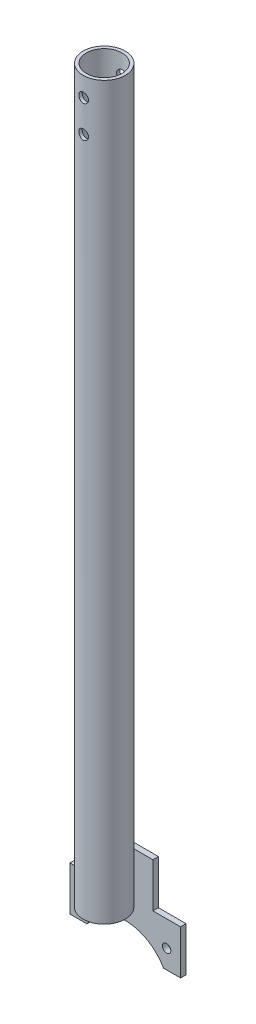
ISO-10303-21;
HEADER;
FILE_DESCRIPTION(('STEP AP214'),'2;1');
FILE_NAME('part.step','',(''),(''),'','','');
FILE_SCHEMA(('AUTOMOTIVE_DESIGN { 1 0 10303 214 1 1 1 1 }'));
ENDSEC;
DATA;
#1=APPLICATION_CONTEXT('core data for automotive mechanical design processes');
#2=APPLICATION_PROTOCOL_DEFINITION('international standard','automotive_design',2000,#1);
#3=PRODUCT_CONTEXT('',#1,'mechanical');
#4=PRODUCT('Part','Part','',(#3));
#5=PRODUCT_RELATED_PRODUCT_CATEGORY('part','',(#4));
#6=PRODUCT_DEFINITION_FORMATION('','',#4);
#7=PRODUCT_DEFINITION_CONTEXT('part definition',#1,'design');
#8=PRODUCT_DEFINITION('design','',#6,#7);
#9=PRODUCT_DEFINITION_SHAPE('','',#8);
#10=(LENGTH_UNIT() NAMED_UNIT(*) SI_UNIT(.MILLI.,.METRE.));
#11=(NAMED_UNIT(*) PLANE_ANGLE_UNIT() SI_UNIT($,.RADIAN.));
#12=(NAMED_UNIT(*) SI_UNIT($,.STERADIAN.) SOLID_ANGLE_UNIT());
#13=UNCERTAINTY_MEASURE_WITH_UNIT(LENGTH_MEASURE(1.E-05),#10,'distance_accuracy_value','');
#14=(GEOMETRIC_REPRESENTATION_CONTEXT(3) GLOBAL_UNCERTAINTY_ASSIGNED_CONTEXT((#13)) GLOBAL_UNIT_ASSIGNED_CONTEXT((#10,
#11,#12)) REPRESENTATION_CONTEXT('',''));
#15=CARTESIAN_POINT('',(0.,0.,0.));
#16=DIRECTION('',(0.,0.,1.));
#17=DIRECTION('',(1.,0.,0.));
#18=AXIS2_PLACEMENT_3D('',#15,#16,#17);
#19=CARTESIAN_POINT('',(63.5,-50.8,-30.48));
#20=DIRECTION('',(0.,-1.,0.));
#21=DIRECTION('',(1.,0.,0.));
#22=AXIS2_PLACEMENT_3D('',#19,#20,#21);
#23=PLANE('',#22);
#24=DIRECTION('',(0.,0.,1.));
#25=VECTOR('',#24,1.);
#26=CARTESIAN_POINT('',(43.9940905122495,-50.8,-30.48));
#27=LINE('',#26,#25);
#28=CARTESIAN_POINT('',(43.9940905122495,-50.8,-30.48));
#29=VERTEX_POINT('',#28);
#30=CARTESIAN_POINT('',(43.9940905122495,-50.8,-24.13));
#31=VERTEX_POINT('',#30);
#32=EDGE_CURVE('E64',#29,#31,#27,.T.);
#33=ORIENTED_EDGE('',*,*,#32,.F.);
#34=DIRECTION('',(1.,0.,0.));
#35=VECTOR('',#34,1.);
#36=CARTESIAN_POINT('',(63.5,-50.8,-30.48));
#37=LINE('',#36,#35);
#38=CARTESIAN_POINT('',(63.5,-50.8,-30.48));
#39=VERTEX_POINT('',#38);
#40=EDGE_CURVE('E70',#29,#39,#37,.T.);
#41=ORIENTED_EDGE('',*,*,#40,.T.);
#42=DIRECTION('',(0.,0.,1.));
#43=VECTOR('',#42,1.);
#44=CARTESIAN_POINT('',(63.5,-50.8,-30.48));
#45=LINE('',#44,#43);
#46=CARTESIAN_POINT('',(63.5,-50.8,-24.13));
#47=VERTEX_POINT('',#46);
#48=EDGE_CURVE('E12',#39,#47,#45,.T.);
#49=ORIENTED_EDGE('',*,*,#48,.T.);
#50=DIRECTION('',(1.,0.,0.));
#51=VECTOR('',#50,1.);
#52=CARTESIAN_POINT('',(63.5,-50.8,-24.13));
#53=LINE('',#52,#51);
#54=EDGE_CURVE('E134',#31,#47,#53,.T.);
#55=ORIENTED_EDGE('',*,*,#54,.F.);
#56=EDGE_LOOP('',(#33,#41,#49,#55));
#57=FACE_BOUND('',#56,.T.);
#58=ADVANCED_FACE('F47',(#57),#23,.T.);
#59=CARTESIAN_POINT('',(63.5,0.,-30.48));
#60=DIRECTION('',(1.,0.,0.));
#61=DIRECTION('',(0.,0.,-1.));
#62=AXIS2_PLACEMENT_3D('',#59,#60,#61);
#63=PLANE('',#62);
#64=DIRECTION('',(0.,1.,0.));
#65=VECTOR('',#64,1.);
#66=CARTESIAN_POINT('',(63.5,0.,-24.13));
#67=LINE('',#66,#65);
#68=CARTESIAN_POINT('',(63.5,0.,-24.13));
#69=VERTEX_POINT('',#68);
#70=EDGE_CURVE('E135',#47,#69,#67,.T.);
#71=ORIENTED_EDGE('',*,*,#70,.F.);
#72=ORIENTED_EDGE('',*,*,#48,.F.);
#73=DIRECTION('',(0.,1.,0.));
#74=VECTOR('',#73,1.);
#75=CARTESIAN_POINT('',(63.5,0.,-30.48));
#76=LINE('',#75,#74);
#77=CARTESIAN_POINT('',(63.5,0.,-30.48));
#78=VERTEX_POINT('',#77);
#79=EDGE_CURVE('E141',#39,#78,#76,.T.);
#80=ORIENTED_EDGE('',*,*,#79,.T.);
#81=DIRECTION('',(0.,0.,1.));
#82=VECTOR('',#81,1.);
#83=CARTESIAN_POINT('',(63.5,0.,-30.48));
#84=LINE('',#83,#82);
#85=EDGE_CURVE('E145',#78,#69,#84,.T.);
#86=ORIENTED_EDGE('',*,*,#85,.T.);
#87=EDGE_LOOP('',(#71,#72,#80,#86));
#88=FACE_BOUND('',#87,.T.);
#89=ADVANCED_FACE('F49',(#88),#63,.T.);
#90=DIRECTION('',(0.,0.,1.));
#91=VECTOR('',#90,1.);
#92=CARTESIAN_POINT('',(-43.9940905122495,-50.8,-30.48));
#93=LINE('',#92,#91);
#94=CARTESIAN_POINT('',(-43.9940905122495,-50.8,-24.13));
#95=VERTEX_POINT('',#94);
#96=CARTESIAN_POINT('',(-43.9940905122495,-50.8,-30.48));
#97=VERTEX_POINT('',#96);
#98=EDGE_CURVE('E127',#95,#97,#93,.F.);
#99=ORIENTED_EDGE('',*,*,#98,.F.);
#100=CARTESIAN_POINT('',(-63.5,-50.8,-24.13));
#101=VERTEX_POINT('',#100);
#102=EDGE_CURVE('E197',#101,#95,#53,.T.);
#103=ORIENTED_EDGE('',*,*,#102,.F.);
#104=DIRECTION('',(0.,0.,1.));
#105=VECTOR('',#104,1.);
#106=CARTESIAN_POINT('',(-63.5,-50.8,-30.48));
#107=LINE('',#106,#105);
#108=CARTESIAN_POINT('',(-63.5,-50.8,-30.48));
#109=VERTEX_POINT('',#108);
#110=EDGE_CURVE('E56',#109,#101,#107,.T.);
#111=ORIENTED_EDGE('',*,*,#110,.F.);
#112=EDGE_CURVE('E142',#109,#97,#37,.T.);
#113=ORIENTED_EDGE('',*,*,#112,.T.);
#114=EDGE_LOOP('',(#99,#103,#111,#113));
#115=FACE_BOUND('',#114,.T.);
#116=ADVANCED_FACE('F240',(#115),#23,.T.);
#117=CARTESIAN_POINT('',(-63.5,-50.8,-30.48));
#118=DIRECTION('',(-1.,0.,0.));
#119=DIRECTION('',(0.,0.,1.));
#120=AXIS2_PLACEMENT_3D('',#117,#118,#119);
#121=PLANE('',#120);
#122=DIRECTION('',(0.,-1.,0.));
#123=VECTOR('',#122,1.);
#124=CARTESIAN_POINT('',(-63.5,-50.8,-24.13));
#125=LINE('',#124,#123);
#126=CARTESIAN_POINT('',(-63.5,0.,-24.13));
#127=VERTEX_POINT('',#126);
#128=EDGE_CURVE('E194',#127,#101,#125,.T.);
#129=ORIENTED_EDGE('',*,*,#128,.F.);
#130=DIRECTION('',(0.,0.,1.));
#131=VECTOR('',#130,1.);
#132=CARTESIAN_POINT('',(-63.5,0.,-30.48));
#133=LINE('',#132,#131);
#134=CARTESIAN_POINT('',(-63.5,0.,-30.48));
#135=VERTEX_POINT('',#134);
#136=EDGE_CURVE('E152',#135,#127,#133,.T.);
#137=ORIENTED_EDGE('',*,*,#136,.F.);
#138=DIRECTION('',(0.,-1.,0.));
#139=VECTOR('',#138,1.);
#140=CARTESIAN_POINT('',(-63.5,-50.8,-30.48));
#141=LINE('',#140,#139);
#142=EDGE_CURVE('E143',#135,#109,#141,.T.);
#143=ORIENTED_EDGE('',*,*,#142,.T.);
#144=ORIENTED_EDGE('',*,*,#110,.T.);
#145=EDGE_LOOP('',(#129,#137,#143,#144));
#146=FACE_BOUND('',#145,.T.);
#147=ADVANCED_FACE('F242',(#146),#121,.T.);
#148=CARTESIAN_POINT('',(-63.5,0.,-30.48));
#149=DIRECTION('',(0.,1.,0.));
#150=DIRECTION('',(-1.,0.,0.));
#151=AXIS2_PLACEMENT_3D('',#148,#149,#150);
#152=PLANE('',#151);
#153=DIRECTION('',(-1.,0.,0.));
#154=VECTOR('',#153,1.);
#155=CARTESIAN_POINT('',(-63.5,0.,-24.13));
#156=LINE('',#155,#154);
#157=CARTESIAN_POINT('',(-31.75,0.,-24.13));
#158=VERTEX_POINT('',#157);
#159=EDGE_CURVE('E191',#158,#127,#156,.T.);
#160=ORIENTED_EDGE('',*,*,#159,.F.);
#161=DIRECTION('',(0.,0.,1.));
#162=VECTOR('',#161,1.);
#163=CARTESIAN_POINT('',(-31.75,0.,-30.48));
#164=LINE('',#163,#162);
#165=CARTESIAN_POINT('',(-31.75,0.,-30.48));
#166=VERTEX_POINT('',#165);
#167=EDGE_CURVE('E154',#166,#158,#164,.T.);
#168=ORIENTED_EDGE('',*,*,#167,.F.);
#169=DIRECTION('',(-1.,0.,0.));
#170=VECTOR('',#169,1.);
#171=CARTESIAN_POINT('',(-63.5,0.,-30.48));
#172=LINE('',#171,#170);
#173=EDGE_CURVE('E147',#166,#135,#172,.T.);
#174=ORIENTED_EDGE('',*,*,#173,.T.);
#175=ORIENTED_EDGE('',*,*,#136,.T.);
#176=EDGE_LOOP('',(#160,#168,#174,#175));
#177=FACE_BOUND('',#176,.T.);
#178=ADVANCED_FACE('F216',(#177),#152,.T.);
#179=CARTESIAN_POINT('',(-31.75,0.,-30.48));
#180=DIRECTION('',(-1.,0.,0.));
#181=DIRECTION('',(0.,0.,1.));
#182=AXIS2_PLACEMENT_3D('',#179,#180,#181);
#183=PLANE('',#182);
#184=DIRECTION('',(0.,-1.,0.));
#185=VECTOR('',#184,1.);
#186=CARTESIAN_POINT('',(-31.75,0.,-24.13));
#187=LINE('',#186,#185);
#188=CARTESIAN_POINT('',(-31.75,50.8,-24.13));
#189=VERTEX_POINT('',#188);
#190=EDGE_CURVE('E188',#189,#158,#187,.T.);
#191=ORIENTED_EDGE('',*,*,#190,.F.);
#192=DIRECTION('',(0.,0.,1.));
#193=VECTOR('',#192,1.);
#194=CARTESIAN_POINT('',(-31.75,50.8,-30.48));
#195=LINE('',#194,#193);
#196=CARTESIAN_POINT('',(-31.75,50.8,-30.48));
#197=VERTEX_POINT('',#196);
#198=EDGE_CURVE('E156',#197,#189,#195,.T.);
#199=ORIENTED_EDGE('',*,*,#198,.F.);
#200=DIRECTION('',(0.,-1.,0.));
#201=VECTOR('',#200,1.);
#202=CARTESIAN_POINT('',(-31.75,0.,-30.48));
#203=LINE('',#202,#201);
#204=EDGE_CURVE('E210',#197,#166,#203,.T.);
#205=ORIENTED_EDGE('',*,*,#204,.T.);
#206=ORIENTED_EDGE('',*,*,#167,.T.);
#207=EDGE_LOOP('',(#191,#199,#205,#206));
#208=FACE_BOUND('',#207,.T.);
#209=ADVANCED_FACE('F223',(#208),#183,.T.);
#210=CARTESIAN_POINT('',(-31.75,50.8,-30.48));
#211=DIRECTION('',(0.,1.,0.));
#212=DIRECTION('',(0.,0.,1.));
#213=AXIS2_PLACEMENT_3D('',#210,#211,#212);
#214=PLANE('',#213);
#215=DIRECTION('',(-1.,0.,0.));
#216=VECTOR('',#215,1.);
#217=CARTESIAN_POINT('',(-31.75,50.8,-24.13));
#218=LINE('',#217,#216);
#219=CARTESIAN_POINT('',(31.75,50.8,-24.13));
#220=VERTEX_POINT('',#219);
#221=EDGE_CURVE('E185',#220,#189,#218,.T.);
#222=ORIENTED_EDGE('',*,*,#221,.F.);
#223=DIRECTION('',(0.,0.,1.));
#224=VECTOR('',#223,1.);
#225=CARTESIAN_POINT('',(31.75,50.8,-30.48));
#226=LINE('',#225,#224);
#227=CARTESIAN_POINT('',(31.75,50.8,-30.48));
#228=VERTEX_POINT('',#227);
#229=EDGE_CURVE('E158',#228,#220,#226,.T.);
#230=ORIENTED_EDGE('',*,*,#229,.F.);
#231=DIRECTION('',(-1.,0.,0.));
#232=VECTOR('',#231,1.);
#233=CARTESIAN_POINT('',(-31.75,50.8,-30.48));
#234=LINE('',#233,#232);
#235=EDGE_CURVE('E207',#228,#197,#234,.T.);
#236=ORIENTED_EDGE('',*,*,#235,.T.);
#237=ORIENTED_EDGE('',*,*,#198,.T.);
#238=EDGE_LOOP('',(#222,#230,#236,#237));
#239=FACE_BOUND('',#238,.T.);
#240=ADVANCED_FACE('F226',(#239),#214,.T.);
#241=CARTESIAN_POINT('',(31.75,50.8,-30.48));
#242=DIRECTION('',(1.,0.,0.));
#243=DIRECTION('',(0.,1.,0.));
#244=AXIS2_PLACEMENT_3D('',#241,#242,#243);
#245=PLANE('',#244);
#246=DIRECTION('',(0.,1.,0.));
#247=VECTOR('',#246,1.);
#248=CARTESIAN_POINT('',(31.75,50.8,-24.13));
#249=LINE('',#248,#247);
#250=CARTESIAN_POINT('',(31.75,0.,-24.13));
#251=VERTEX_POINT('',#250);
#252=EDGE_CURVE('E182',#251,#220,#249,.T.);
#253=ORIENTED_EDGE('',*,*,#252,.F.);
#254=DIRECTION('',(0.,0.,1.));
#255=VECTOR('',#254,1.);
#256=CARTESIAN_POINT('',(31.75,0.,-30.48));
#257=LINE('',#256,#255);
#258=CARTESIAN_POINT('',(31.75,0.,-30.48));
#259=VERTEX_POINT('',#258);
#260=EDGE_CURVE('E160',#259,#251,#257,.T.);
#261=ORIENTED_EDGE('',*,*,#260,.F.);
#262=DIRECTION('',(0.,1.,0.));
#263=VECTOR('',#262,1.);
#264=CARTESIAN_POINT('',(31.75,50.8,-30.48));
#265=LINE('',#264,#263);
#266=EDGE_CURVE('E204',#259,#228,#265,.T.);
#267=ORIENTED_EDGE('',*,*,#266,.T.);
#268=ORIENTED_EDGE('',*,*,#229,.T.);
#269=EDGE_LOOP('',(#253,#261,#267,#268));
#270=FACE_BOUND('',#269,.T.);
#271=ADVANCED_FACE('F230',(#270),#245,.T.);
#272=CARTESIAN_POINT('',(31.75,0.,-30.48));
#273=DIRECTION('',(0.,1.,0.));
#274=DIRECTION('',(-1.,0.,0.));
#275=AXIS2_PLACEMENT_3D('',#272,#273,#274);
#276=PLANE('',#275);
#277=DIRECTION('',(-1.,0.,0.));
#278=VECTOR('',#277,1.);
#279=CARTESIAN_POINT('',(31.75,0.,-24.13));
#280=LINE('',#279,#278);
#281=EDGE_CURVE('E179',#69,#251,#280,.T.);
#282=ORIENTED_EDGE('',*,*,#281,.F.);
#283=ORIENTED_EDGE('',*,*,#85,.F.);
#284=DIRECTION('',(-1.,0.,0.));
#285=VECTOR('',#284,1.);
#286=CARTESIAN_POINT('',(31.75,0.,-30.48));
#287=LINE('',#286,#285);
#288=EDGE_CURVE('E201',#78,#259,#287,.T.);
#289=ORIENTED_EDGE('',*,*,#288,.T.);
#290=ORIENTED_EDGE('',*,*,#260,.T.);
#291=EDGE_LOOP('',(#282,#283,#289,#290));
#292=FACE_BOUND('',#291,.T.);
#293=ADVANCED_FACE('F233',(#292),#276,.T.);
#294=CARTESIAN_POINT('',(63.5,50.8,-30.48));
#295=DIRECTION('',(0.,0.,1.));
#296=DIRECTION('',(1.,0.,0.));
#297=AXIS2_PLACEMENT_3D('',#294,#295,#296);
#298=PLANE('',#297);
#299=CARTESIAN_POINT('',(-46.8197830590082,-29.3038456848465,-30.48));
#300=DIRECTION('',(0.,0.,-1.));
#301=DIRECTION('',(-1.,0.,0.));
#302=AXIS2_PLACEMENT_3D('',#299,#300,#301);
#303=CIRCLE('',#302,4.826);
#304=CARTESIAN_POINT('',(-51.6457830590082,-29.3038456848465,-30.48));
#305=VERTEX_POINT('',#304);
#306=EDGE_CURVE('E173',#305,#305,#303,.T.);
#307=ORIENTED_EDGE('',*,*,#306,.F.);
#308=EDGE_LOOP('',(#307));
#309=FACE_BOUND('',#308,.T.);
#310=CARTESIAN_POINT('',(47.4729058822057,-29.3117346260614,-30.48));
#311=DIRECTION('',(0.,0.,-1.));
#312=DIRECTION('',(-1.,0.,0.));
#313=AXIS2_PLACEMENT_3D('',#310,#311,#312);
#314=CIRCLE('',#313,4.826);
#315=CARTESIAN_POINT('',(42.6469058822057,-29.3117346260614,-30.48));
#316=VERTEX_POINT('',#315);
#317=EDGE_CURVE('E164',#316,#316,#314,.T.);
#318=ORIENTED_EDGE('',*,*,#317,.F.);
#319=EDGE_LOOP('',(#318));
#320=FACE_BOUND('',#319,.T.);
#321=ORIENTED_EDGE('',*,*,#40,.F.);
#322=CARTESIAN_POINT('',(0.,-76.2,-30.48));
#323=DIRECTION('',(0.,0.,1.));
#324=DIRECTION('',(1.,0.,0.));
#325=AXIS2_PLACEMENT_3D('',#322,#323,#324);
#326=CIRCLE('',#325,50.8);
#327=EDGE_CURVE('E124',#29,#97,#326,.T.);
#328=ORIENTED_EDGE('',*,*,#327,.T.);
#329=ORIENTED_EDGE('',*,*,#112,.F.);
#330=ORIENTED_EDGE('',*,*,#142,.F.);
#331=ORIENTED_EDGE('',*,*,#173,.F.);
#332=ORIENTED_EDGE('',*,*,#204,.F.);
#333=ORIENTED_EDGE('',*,*,#235,.F.);
#334=ORIENTED_EDGE('',*,*,#266,.F.);
#335=ORIENTED_EDGE('',*,*,#288,.F.);
#336=ORIENTED_EDGE('',*,*,#79,.F.);
#337=EDGE_LOOP('',(#321,#328,#329,#330,#331,#332,#333,#334,#335,#336));
#338=FACE_BOUND('',#337,.T.);
#339=ADVANCED_FACE('F138',(#309,#320,#338),#298,.F.);
#340=CARTESIAN_POINT('',(63.5,50.8,-24.13));
#341=DIRECTION('',(0.,0.,1.));
#342=DIRECTION('',(1.,0.,0.));
#343=AXIS2_PLACEMENT_3D('',#340,#341,#342);
#344=PLANE('',#343);
#345=CARTESIAN_POINT('',(-46.8197830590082,-29.3038456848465,-24.13));
#346=DIRECTION('',(0.,0.,1.));
#347=DIRECTION('',(1.,0.,0.));
#348=AXIS2_PLACEMENT_3D('',#345,#346,#347);
#349=CIRCLE('',#348,4.826);
#350=CARTESIAN_POINT('',(-41.9937830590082,-29.3038456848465,-24.13));
#351=VERTEX_POINT('',#350);
#352=EDGE_CURVE('E51',#351,#351,#349,.T.);
#353=ORIENTED_EDGE('',*,*,#352,.F.);
#354=EDGE_LOOP('',(#353));
#355=FACE_BOUND('',#354,.T.);
#356=CARTESIAN_POINT('',(47.4729058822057,-29.3117346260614,-24.13));
#357=DIRECTION('',(0.,0.,1.));
#358=DIRECTION('',(1.,0.,0.));
#359=AXIS2_PLACEMENT_3D('',#356,#357,#358);
#360=CIRCLE('',#359,4.826);
#361=CARTESIAN_POINT('',(52.2989058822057,-29.3117346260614,-24.13));
#362=VERTEX_POINT('',#361);
#363=EDGE_CURVE('E162',#362,#362,#360,.T.);
#364=ORIENTED_EDGE('',*,*,#363,.F.);
#365=EDGE_LOOP('',(#364));
#366=FACE_BOUND('',#365,.T.);
#367=CARTESIAN_POINT('',(0.,-76.2,-24.13));
#368=DIRECTION('',(0.,0.,1.));
#369=DIRECTION('',(1.,0.,0.));
#370=AXIS2_PLACEMENT_3D('',#367,#368,#369);
#371=CIRCLE('',#370,50.8);
#372=EDGE_CURVE('E131',#31,#95,#371,.T.);
#373=ORIENTED_EDGE('',*,*,#372,.F.);
#374=ORIENTED_EDGE('',*,*,#54,.T.);
#375=ORIENTED_EDGE('',*,*,#70,.T.);
#376=ORIENTED_EDGE('',*,*,#281,.T.);
#377=ORIENTED_EDGE('',*,*,#252,.T.);
#378=ORIENTED_EDGE('',*,*,#221,.T.);
#379=ORIENTED_EDGE('',*,*,#190,.T.);
#380=ORIENTED_EDGE('',*,*,#159,.T.);
#381=ORIENTED_EDGE('',*,*,#128,.T.);
#382=ORIENTED_EDGE('',*,*,#102,.T.);
#383=EDGE_LOOP('',(#373,#374,#375,#376,#377,#378,#379,#380,#381,#382));
#384=FACE_BOUND('',#383,.T.);
#385=ADVANCED_FACE('F237',(#355,#366,#384),#344,.T.);
#386=CARTESIAN_POINT('',(0.,-76.2,-30.48));
#387=DIRECTION('',(0.,0.,1.));
#388=DIRECTION('',(1.,0.,0.));
#389=AXIS2_PLACEMENT_3D('',#386,#387,#388);
#390=CYLINDRICAL_SURFACE('',#389,50.8);
#391=ORIENTED_EDGE('',*,*,#32,.T.);
#392=ORIENTED_EDGE('',*,*,#372,.T.);
#393=ORIENTED_EDGE('',*,*,#98,.T.);
#394=ORIENTED_EDGE('',*,*,#327,.F.);
#395=EDGE_LOOP('',(#391,#392,#393,#394));
#396=FACE_BOUND('',#395,.T.);
#397=ADVANCED_FACE('F125',(#396),#390,.F.);
#398=CARTESIAN_POINT('',(47.4729058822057,-29.3117346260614,24.13));
#399=DIRECTION('',(0.,0.,-1.));
#400=DIRECTION('',(-1.,0.,0.));
#401=AXIS2_PLACEMENT_3D('',#398,#399,#400);
#402=CYLINDRICAL_SURFACE('',#401,4.826);
#403=ORIENTED_EDGE('',*,*,#363,.T.);
#404=EDGE_LOOP('',(#403));
#405=FACE_BOUND('',#404,.T.);
#406=ORIENTED_EDGE('',*,*,#317,.T.);
#407=EDGE_LOOP('',(#406));
#408=FACE_BOUND('',#407,.T.);
#409=ADVANCED_FACE('F264',(#405,#408),#402,.F.);
#410=CARTESIAN_POINT('',(-46.8197830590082,-29.3038456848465,24.13));
#411=DIRECTION('',(0.,0.,-1.));
#412=DIRECTION('',(-1.,0.,0.));
#413=AXIS2_PLACEMENT_3D('',#410,#411,#412);
#414=CYLINDRICAL_SURFACE('',#413,4.826);
#415=ORIENTED_EDGE('',*,*,#352,.T.);
#416=EDGE_LOOP('',(#415));
#417=FACE_BOUND('',#416,.T.);
#418=ORIENTED_EDGE('',*,*,#306,.T.);
#419=EDGE_LOOP('',(#418));
#420=FACE_BOUND('',#419,.T.);
#421=ADVANCED_FACE('F267',(#417,#420),#414,.F.);
#422=CLOSED_SHELL('',(#58,#89,#116,#147,#178,#209,#240,#271,#293,#339,#385,#397,#409,#421));
#423=MANIFOLD_SOLID_BREP('B2',#422);
#424=CARTESIAN_POINT('',(0.,838.2,0.));
#425=DIRECTION('',(0.,-1.,0.));
#426=DIRECTION('',(0.,0.,-1.));
#427=AXIS2_PLACEMENT_3D('',#424,#425,#426);
#428=CYLINDRICAL_SURFACE('',#427,24.13);
#429=CARTESIAN_POINT('',(0.,838.2,0.));
#430=DIRECTION('',(0.,1.,0.));
#431=DIRECTION('',(0.,0.,1.));
#432=AXIS2_PLACEMENT_3D('',#429,#430,#431);
#433=CIRCLE('',#432,24.13);
#434=CARTESIAN_POINT('',(0.,838.2,24.13));
#435=VERTEX_POINT('',#434);
#436=EDGE_CURVE('E46',#435,#435,#433,.T.);
#437=ORIENTED_EDGE('',*,*,#436,.F.);
#438=EDGE_LOOP('',(#437));
#439=FACE_BOUND('',#438,.T.);
#440=CARTESIAN_POINT('',(0.,0.,0.));
#441=DIRECTION('',(0.,1.,0.));
#442=DIRECTION('',(0.,0.,1.));
#443=AXIS2_PLACEMENT_3D('',#440,#441,#442);
#444=CIRCLE('',#443,24.13);
#445=CARTESIAN_POINT('',(0.,0.,24.13));
#446=VERTEX_POINT('',#445);
#447=EDGE_CURVE('E378',#446,#446,#444,.T.);
#448=ORIENTED_EDGE('',*,*,#447,.T.);
#449=EDGE_LOOP('',(#448));
#450=FACE_BOUND('',#449,.T.);
#451=CARTESIAN_POINT('',(0.,821.5249,-24.13));
#452=CARTESIAN_POINT('',(0.153752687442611,821.524903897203,-24.1300022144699));
#453=CARTESIAN_POINT('',(0.307460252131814,821.518509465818,-24.1285281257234));
#454=CARTESIAN_POINT('',(0.613804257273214,821.492992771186,-24.1226777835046));
#455=CARTESIAN_POINT('',(0.76644054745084,821.473868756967,-24.1183011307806));
#456=CARTESIAN_POINT('',(1.06955059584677,821.423034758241,-24.1067622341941));
#457=CARTESIAN_POINT('',(1.22002346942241,821.391319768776,-24.0995988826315));
#458=CARTESIAN_POINT('',(1.51773943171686,821.315548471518,-24.0826826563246));
#459=CARTESIAN_POINT('',(1.6649813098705,821.271487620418,-24.0729288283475));
#460=CARTESIAN_POINT('',(1.95493496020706,821.171451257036,-24.0511172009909));
#461=CARTESIAN_POINT('',(2.09765315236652,821.115493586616,-24.0390628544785));
#462=CARTESIAN_POINT('',(2.37787434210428,820.992026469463,-24.0129636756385));
#463=CARTESIAN_POINT('',(2.51537539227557,820.924512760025,-23.9989181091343));
#464=CARTESIAN_POINT('',(2.78414256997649,820.778469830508,-23.9692245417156));
#465=CARTESIAN_POINT('',(2.91541115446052,820.699945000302,-23.9535771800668));
#466=CARTESIAN_POINT('',(3.17096811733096,820.532379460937,-23.9210882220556));
#467=CARTESIAN_POINT('',(3.29525385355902,820.443334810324,-23.904246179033));
#468=CARTESIAN_POINT('',(3.53785744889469,820.253902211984,-23.869556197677));
#469=CARTESIAN_POINT('',(3.65605343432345,820.153360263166,-23.851696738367));
#470=CARTESIAN_POINT('',(3.88363577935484,819.942721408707,-23.815699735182));
#471=CARTESIAN_POINT('',(3.99301885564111,819.832620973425,-23.7975620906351));
#472=CARTESIAN_POINT('',(4.20217302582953,819.603659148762,-23.761521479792));
#473=CARTESIAN_POINT('',(4.30194669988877,819.484800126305,-23.7436184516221));
#474=CARTESIAN_POINT('',(4.4912749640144,819.239032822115,-23.7085348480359));
#475=CARTESIAN_POINT('',(4.58082576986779,819.112121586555,-23.6913545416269));
#476=CARTESIAN_POINT('',(4.75005229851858,818.849556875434,-23.6580099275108));
#477=CARTESIAN_POINT('',(4.82959653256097,818.713816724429,-23.6418602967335));
#478=CARTESIAN_POINT('',(4.97697297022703,818.435871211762,-23.6112749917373));
#479=CARTESIAN_POINT('',(5.04480075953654,818.293663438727,-23.5968399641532));
#480=CARTESIAN_POINT('',(5.16815383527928,818.003878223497,-23.5701310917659));
#481=CARTESIAN_POINT('',(5.22368496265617,817.85630336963,-23.5578562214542));
#482=CARTESIAN_POINT('',(5.32205296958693,817.55678362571,-23.5358271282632));
#483=CARTESIAN_POINT('',(5.36488527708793,817.404837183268,-23.5260738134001));
#484=CARTESIAN_POINT('',(5.4724492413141,816.949465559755,-23.5013792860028));
#485=CARTESIAN_POINT('',(5.51851416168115,816.641157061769,-23.4904947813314));
#486=CARTESIAN_POINT('',(5.55840479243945,816.021181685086,-23.4810866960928));
#487=CARTESIAN_POINT('',(5.55223763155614,815.709515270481,-23.482561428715));
#488=CARTESIAN_POINT('',(5.48862550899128,815.098144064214,-23.4975082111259));
#489=CARTESIAN_POINT('',(5.43222250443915,814.798324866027,-23.5107364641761));
#490=CARTESIAN_POINT('',(5.27137544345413,814.212533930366,-23.5473190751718));
#491=CARTESIAN_POINT('',(5.16692843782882,813.926563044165,-23.5706740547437));
#492=CARTESIAN_POINT('',(4.91203034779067,813.37368890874,-23.6251116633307));
#493=CARTESIAN_POINT('',(4.76118635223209,813.106973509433,-23.6562598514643));
#494=CARTESIAN_POINT('',(4.41805057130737,812.602259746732,-23.7227355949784));
#495=CARTESIAN_POINT('',(4.22575257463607,812.364265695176,-23.7580637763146));
#496=CARTESIAN_POINT('',(3.79969141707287,811.917757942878,-23.8299585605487));
#497=CARTESIAN_POINT('',(3.56504422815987,811.710088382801,-23.8665345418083));
#498=CARTESIAN_POINT('',(3.06383030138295,811.336901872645,-23.9360346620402));
#499=CARTESIAN_POINT('',(2.7972628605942,811.171385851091,-23.9689587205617));
#500=CARTESIAN_POINT('',(2.23868498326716,810.886961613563,-24.0275706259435));
#501=CARTESIAN_POINT('',(1.94661149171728,810.768173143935,-24.0532398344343));
#502=CARTESIAN_POINT('',(1.34592500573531,810.5816021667,-24.0943125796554));
#503=CARTESIAN_POINT('',(1.03731468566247,810.513811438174,-24.1097177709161));
#504=CARTESIAN_POINT('',(0.419547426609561,810.432409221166,-24.1282879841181));
#505=CARTESIAN_POINT('',(0.110549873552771,810.417645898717,-24.1317131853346));
#506=CARTESIAN_POINT('',(-0.505497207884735,810.439582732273,-24.1266707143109));
#507=CARTESIAN_POINT('',(-0.812546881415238,810.476279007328,-24.1182039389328));
#508=CARTESIAN_POINT('',(-1.41210132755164,810.599139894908,-24.0904939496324));
#509=CARTESIAN_POINT('',(-1.70473834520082,810.684691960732,-24.0713842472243));
#510=CARTESIAN_POINT('',(-2.27150368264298,810.902149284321,-24.0245313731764));
#511=CARTESIAN_POINT('',(-2.54563031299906,811.034058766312,-23.9967874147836));
#512=CARTESIAN_POINT('',(-3.07229444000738,811.342827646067,-23.9351073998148));
#513=CARTESIAN_POINT('',(-3.32443089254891,811.520352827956,-23.9010819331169));
#514=CARTESIAN_POINT('',(-3.79574691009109,811.914447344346,-23.8307802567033));
#515=CARTESIAN_POINT('',(-4.01492170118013,812.131022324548,-23.7945037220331));
#516=CARTESIAN_POINT('',(-4.41871490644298,812.602373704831,-23.7228762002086));
#517=CARTESIAN_POINT('',(-4.60253181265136,812.857842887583,-23.6875594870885));
#518=CARTESIAN_POINT('',(-4.92466304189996,813.396709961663,-23.6226947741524));
#519=CARTESIAN_POINT('',(-5.0629793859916,813.680106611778,-23.5931465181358));
#520=CARTESIAN_POINT('',(-5.2892097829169,814.265178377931,-23.5434611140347));
#521=CARTESIAN_POINT('',(-5.37741629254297,814.566735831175,-23.5232694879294));
#522=CARTESIAN_POINT('',(-5.50173962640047,815.181100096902,-23.4945097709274));
#523=CARTESIAN_POINT('',(-5.53786580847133,815.493904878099,-23.4859395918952));
#524=CARTESIAN_POINT('',(-5.55200202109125,815.96024658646,-23.4825901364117));
#525=CARTESIAN_POINT('',(-5.55028802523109,816.113399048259,-23.4829987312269));
#526=CARTESIAN_POINT('',(-5.53422309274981,816.418986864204,-23.486791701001));
#527=CARTESIAN_POINT('',(-5.51987700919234,816.571422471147,-23.4901749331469));
#528=CARTESIAN_POINT('',(-5.4786530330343,816.874537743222,-23.4998233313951));
#529=CARTESIAN_POINT('',(-5.45177085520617,817.025216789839,-23.5060894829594));
#530=CARTESIAN_POINT('',(-5.38570793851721,817.32366074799,-23.5213137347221));
#531=CARTESIAN_POINT('',(-5.34653155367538,817.471426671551,-23.5302708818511));
#532=CARTESIAN_POINT('',(-5.25636461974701,817.762496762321,-23.5505765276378));
#533=CARTESIAN_POINT('',(-5.205421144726,817.905816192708,-23.5619154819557));
#534=CARTESIAN_POINT('',(-5.0920426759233,818.187588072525,-23.5866776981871));
#535=CARTESIAN_POINT('',(-5.02961170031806,818.326042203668,-23.6001002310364));
#536=CARTESIAN_POINT('',(-4.89367055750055,818.597289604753,-23.628662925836));
#537=CARTESIAN_POINT('',(-4.82015555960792,818.730080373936,-23.6438038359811));
#538=CARTESIAN_POINT('',(-4.66260700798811,818.989042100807,-23.6753763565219));
#539=CARTESIAN_POINT('',(-4.5785769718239,819.115215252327,-23.6918075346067));
#540=CARTESIAN_POINT('',(-4.39852558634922,819.362969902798,-23.7259025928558));
#541=CARTESIAN_POINT('',(-4.30227584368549,819.484382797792,-23.7435859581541));
#542=CARTESIAN_POINT('',(-4.10003538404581,819.71866663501,-23.7793428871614));
#543=CARTESIAN_POINT('',(-3.99404803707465,819.831540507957,-23.7974163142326));
#544=CARTESIAN_POINT('',(-3.77294194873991,820.048114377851,-23.8334714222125));
#545=CARTESIAN_POINT('',(-3.65781785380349,820.151808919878,-23.8514530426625));
#546=CARTESIAN_POINT('',(-3.4192942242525,820.349217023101,-23.8868134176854));
#547=CARTESIAN_POINT('',(-3.29589773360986,820.442934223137,-23.90419239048));
#548=CARTESIAN_POINT('',(-3.03967924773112,820.621122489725,-23.9381326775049));
#549=CARTESIAN_POINT('',(-2.90674308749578,820.705432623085,-23.9546776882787));
#550=CARTESIAN_POINT('',(-2.63410018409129,820.862499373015,-23.9861885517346));
#551=CARTESIAN_POINT('',(-2.49439595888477,820.93526024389,-24.0011549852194));
#552=CARTESIAN_POINT('',(-2.20920769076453,821.068677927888,-24.029082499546));
#553=CARTESIAN_POINT('',(-2.06372662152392,821.129340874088,-24.0420445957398));
#554=CARTESIAN_POINT('',(-1.76800979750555,821.238113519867,-24.0655992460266));
#555=CARTESIAN_POINT('',(-1.61777485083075,821.286225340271,-24.076192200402));
#556=CARTESIAN_POINT('',(-1.22754277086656,821.393062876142,-24.0999333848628));
#557=CARTESIAN_POINT('',(-0.984793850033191,821.442424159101,-24.1111432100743));
#558=CARTESIAN_POINT('',(-0.494657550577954,821.508338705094,-24.1261745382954));
#559=CARTESIAN_POINT('',(-0.247270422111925,821.524893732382,-24.1299964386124));
#560=CARTESIAN_POINT('',(0.,821.5249,-24.13));
#561=B_SPLINE_CURVE_WITH_KNOTS('',3,(#451,#452,#453,#454,#455,#456,#457,#458,#459,#460,#461,
#462,#463,#464,#465,#466,#467,#468,#469,#470,#471,#472,#473,#474,#475,#476,#477,#478,#479,#480,
#481,#482,#483,#484,#485,#486,#487,#488,#489,#490,#491,#492,#493,#494,#495,#496,#497,#498,#499,
#500,#501,#502,#503,#504,#505,#506,#507,#508,#509,#510,#511,#512,#513,#514,#515,#516,#517,#518,
#519,#520,#521,#522,#523,#524,#525,#526,#527,#528,#529,#530,#531,#532,#533,#534,#535,#536,#537,
#538,#539,#540,#541,#542,#543,#544,#545,#546,#547,#548,#549,#550,#551,#552,#553,#554,#555,#556,
#557,#558,#559,#560),.UNSPECIFIED.,.T.,.F.,(4,2,2,2,2,2,2,2,2,2,2,2,2,2,2,2,2,2,2,2,2,2,2,2,2,2,
2,2,2,2,2,2,2,2,2,2,2,2,2,2,2,2,2,2,2,2,2,2,2,2,2,2,2,2,4),(0.,0.461040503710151,
0.92214443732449,1.38343184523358,1.84488923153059,2.30565938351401,2.76659986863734,
3.22735710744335,3.6882875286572,4.15633944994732,4.62456494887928,5.09266437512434,
5.56093652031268,6.03483153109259,6.50890470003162,6.98275219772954,7.45677009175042,
8.38753664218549,9.31817616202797,10.2299512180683,11.1417822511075,12.0615582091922,
12.9814720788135,13.9234532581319,14.8654551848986,15.8098556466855,16.7541038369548,
17.677713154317,18.6012528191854,19.5134598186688,20.4257499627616,21.352197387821,
22.2787788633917,23.2243764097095,24.1699319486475,25.1099106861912,26.0497205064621,
26.5087582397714,26.9676196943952,27.4266381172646,27.8854941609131,28.3425454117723,
28.7994370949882,29.2565284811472,29.7134673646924,30.1807502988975,30.6478721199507,
31.1152696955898,31.5824962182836,32.0567758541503,32.5308803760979,33.0047439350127,
33.4785273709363,34.2200286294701,34.9614900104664),.UNSPECIFIED.);
#562=CARTESIAN_POINT('',(0.,821.5249,-24.13));
#563=VERTEX_POINT('',#562);
#564=EDGE_CURVE('E418',#563,#563,#561,.T.);
#565=ORIENTED_EDGE('',*,*,#564,.F.);
#566=EDGE_LOOP('',(#565));
#567=FACE_BOUND('',#566,.T.);
#568=CARTESIAN_POINT('',(0.,810.4251,24.13));
#569=CARTESIAN_POINT('',(0.153752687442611,810.425096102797,24.1300022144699));
#570=CARTESIAN_POINT('',(0.307460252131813,810.431490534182,24.1285281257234));
#571=CARTESIAN_POINT('',(0.613804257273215,810.457007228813,24.1226777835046));
#572=CARTESIAN_POINT('',(0.766440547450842,810.476131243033,24.1183011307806));
#573=CARTESIAN_POINT('',(1.06955059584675,810.526965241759,24.1067622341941));
#574=CARTESIAN_POINT('',(1.22002346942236,810.558680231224,24.0995988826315));
#575=CARTESIAN_POINT('',(1.51773943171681,810.634451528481,24.0826826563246));
#576=CARTESIAN_POINT('',(1.66498130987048,810.678512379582,24.0729288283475));
#577=CARTESIAN_POINT('',(1.95493496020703,810.778548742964,24.0511172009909));
#578=CARTESIAN_POINT('',(2.09765315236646,810.834506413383,24.0390628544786));
#579=CARTESIAN_POINT('',(2.37787434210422,810.957973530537,24.0129636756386));
#580=CARTESIAN_POINT('',(2.51537539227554,811.025487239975,23.9989181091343));
#581=CARTESIAN_POINT('',(2.7841425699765,811.171530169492,23.9692245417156));
#582=CARTESIAN_POINT('',(2.91541115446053,811.250054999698,23.9535771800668));
#583=CARTESIAN_POINT('',(3.17096811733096,811.417620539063,23.9210882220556));
#584=CARTESIAN_POINT('',(3.29525385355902,811.506665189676,23.904246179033));
#585=CARTESIAN_POINT('',(3.53785744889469,811.696097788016,23.869556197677));
#586=CARTESIAN_POINT('',(3.65605343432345,811.796639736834,23.851696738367));
#587=CARTESIAN_POINT('',(3.88363577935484,812.007278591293,23.815699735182));
#588=CARTESIAN_POINT('',(3.99301885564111,812.117379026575,23.7975620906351));
#589=CARTESIAN_POINT('',(4.20217302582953,812.346340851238,23.761521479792));
#590=CARTESIAN_POINT('',(4.30194669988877,812.465199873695,23.7436184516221));
#591=CARTESIAN_POINT('',(4.4912749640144,812.710967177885,23.7085348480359));
#592=CARTESIAN_POINT('',(4.58082576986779,812.837878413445,23.6913545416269));
#593=CARTESIAN_POINT('',(4.75005229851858,813.100443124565,23.6580099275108));
#594=CARTESIAN_POINT('',(4.82959653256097,813.236183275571,23.6418602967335));
#595=CARTESIAN_POINT('',(4.97697297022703,813.514128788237,23.6112749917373));
#596=CARTESIAN_POINT('',(5.04480075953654,813.656336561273,23.5968399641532));
#597=CARTESIAN_POINT('',(5.16815383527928,813.946121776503,23.5701310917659));
#598=CARTESIAN_POINT('',(5.22368496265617,814.093696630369,23.5578562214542));
#599=CARTESIAN_POINT('',(5.32205296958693,814.393216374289,23.5358271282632));
#600=CARTESIAN_POINT('',(5.36488527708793,814.545162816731,23.5260738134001));
#601=CARTESIAN_POINT('',(5.4724492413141,815.000534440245,23.5013792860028));
#602=CARTESIAN_POINT('',(5.51851416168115,815.308842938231,23.4904947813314));
#603=CARTESIAN_POINT('',(5.55840479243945,815.928818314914,23.4810866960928));
#604=CARTESIAN_POINT('',(5.55223763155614,816.240484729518,23.482561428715));
#605=CARTESIAN_POINT('',(5.48862550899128,816.851855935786,23.4975082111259));
#606=CARTESIAN_POINT('',(5.43222250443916,817.151675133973,23.5107364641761));
#607=CARTESIAN_POINT('',(5.27137544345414,817.737466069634,23.5473190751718));
#608=CARTESIAN_POINT('',(5.16692843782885,818.023436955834,23.5706740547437));
#609=CARTESIAN_POINT('',(4.91203034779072,818.57631109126,23.6251116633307));
#610=CARTESIAN_POINT('',(4.76118635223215,818.843026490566,23.6562598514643));
#611=CARTESIAN_POINT('',(4.41805057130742,819.347740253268,23.7227355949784));
#612=CARTESIAN_POINT('',(4.22575257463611,819.585734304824,23.7580637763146));
#613=CARTESIAN_POINT('',(3.7996914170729,820.032242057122,23.8299585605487));
#614=CARTESIAN_POINT('',(3.56504422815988,820.239911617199,23.8665345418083));
#615=CARTESIAN_POINT('',(3.06383030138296,820.613098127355,23.9360346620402));
#616=CARTESIAN_POINT('',(2.7972628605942,820.778614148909,23.9689587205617));
#617=CARTESIAN_POINT('',(2.23868498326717,821.063038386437,24.0275706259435));
#618=CARTESIAN_POINT('',(1.9466114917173,821.181826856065,24.0532398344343));
#619=CARTESIAN_POINT('',(1.34592500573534,821.3683978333,24.0943125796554));
#620=CARTESIAN_POINT('',(1.03731468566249,821.436188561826,24.1097177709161));
#621=CARTESIAN_POINT('',(0.419547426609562,821.517590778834,24.1282879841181));
#622=CARTESIAN_POINT('',(0.110549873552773,821.532354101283,24.1317131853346));
#623=CARTESIAN_POINT('',(-0.505497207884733,821.510417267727,24.1266707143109));
#624=CARTESIAN_POINT('',(-0.812546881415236,821.473720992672,24.1182039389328));
#625=CARTESIAN_POINT('',(-1.41210132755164,821.350860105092,24.0904939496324));
#626=CARTESIAN_POINT('',(-1.70473834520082,821.265308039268,24.0713842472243));
#627=CARTESIAN_POINT('',(-2.27150368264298,821.047850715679,24.0245313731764));
#628=CARTESIAN_POINT('',(-2.54563031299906,820.915941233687,23.9967874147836));
#629=CARTESIAN_POINT('',(-3.07229444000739,820.607172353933,23.9351073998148));
#630=CARTESIAN_POINT('',(-3.32443089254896,820.429647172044,23.9010819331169));
#631=CARTESIAN_POINT('',(-3.79574691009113,820.035552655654,23.8307802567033));
#632=CARTESIAN_POINT('',(-4.01492170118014,819.818977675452,23.7945037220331));
#633=CARTESIAN_POINT('',(-4.41871490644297,819.347626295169,23.7228762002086));
#634=CARTESIAN_POINT('',(-4.60253181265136,819.092157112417,23.6875594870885));
#635=CARTESIAN_POINT('',(-4.92466304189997,818.553290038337,23.6226947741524));
#636=CARTESIAN_POINT('',(-5.0629793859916,818.269893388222,23.5931465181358));
#637=CARTESIAN_POINT('',(-5.28920978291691,817.684821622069,23.5434611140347));
#638=CARTESIAN_POINT('',(-5.37741629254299,817.383264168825,23.5232694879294));
#639=CARTESIAN_POINT('',(-5.50173962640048,816.768899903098,23.4945097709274));
#640=CARTESIAN_POINT('',(-5.53786580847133,816.4560951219,23.4859395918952));
#641=CARTESIAN_POINT('',(-5.55200202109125,815.98975341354,23.4825901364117));
#642=CARTESIAN_POINT('',(-5.55028802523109,815.836600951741,23.4829987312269));
#643=CARTESIAN_POINT('',(-5.53422309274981,815.531013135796,23.486791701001));
#644=CARTESIAN_POINT('',(-5.51987700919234,815.378577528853,23.4901749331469));
#645=CARTESIAN_POINT('',(-5.4786530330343,815.075462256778,23.4998233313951));
#646=CARTESIAN_POINT('',(-5.45177085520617,814.92478321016,23.5060894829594));
#647=CARTESIAN_POINT('',(-5.38570793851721,814.62633925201,23.5213137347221));
#648=CARTESIAN_POINT('',(-5.34653155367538,814.478573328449,23.5302708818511));
#649=CARTESIAN_POINT('',(-5.25636461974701,814.187503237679,23.5505765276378));
#650=CARTESIAN_POINT('',(-5.205421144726,814.044183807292,23.5619154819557));
#651=CARTESIAN_POINT('',(-5.0920426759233,813.762411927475,23.5866776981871));
#652=CARTESIAN_POINT('',(-5.02961170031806,813.623957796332,23.6001002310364));
#653=CARTESIAN_POINT('',(-4.89367055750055,813.352710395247,23.628662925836));
#654=CARTESIAN_POINT('',(-4.82015555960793,813.219919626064,23.6438038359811));
#655=CARTESIAN_POINT('',(-4.66260700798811,812.960957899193,23.6753763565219));
#656=CARTESIAN_POINT('',(-4.57857697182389,812.834784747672,23.6918075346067));
#657=CARTESIAN_POINT('',(-4.39852558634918,812.587030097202,23.7259025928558));
#658=CARTESIAN_POINT('',(-4.30227584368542,812.465617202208,23.7435859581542));
#659=CARTESIAN_POINT('',(-4.10003538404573,812.231333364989,23.7793428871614));
#660=CARTESIAN_POINT('',(-3.99404803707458,812.118459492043,23.7974163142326));
#661=CARTESIAN_POINT('',(-3.77294194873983,811.901885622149,23.8334714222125));
#662=CARTESIAN_POINT('',(-3.65781785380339,811.798191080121,23.8514530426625));
#663=CARTESIAN_POINT('',(-3.41929422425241,811.600782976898,23.8868134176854));
#664=CARTESIAN_POINT('',(-3.29589773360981,811.507065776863,23.90419239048));
#665=CARTESIAN_POINT('',(-3.03967924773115,811.328877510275,23.9381326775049));
#666=CARTESIAN_POINT('',(-2.90674308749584,811.244567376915,23.9546776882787));
#667=CARTESIAN_POINT('',(-2.63410018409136,811.087500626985,23.9861885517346));
#668=CARTESIAN_POINT('',(-2.4943959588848,811.014739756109,24.0011549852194));
#669=CARTESIAN_POINT('',(-2.20920769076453,810.881322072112,24.029082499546));
#670=CARTESIAN_POINT('',(-2.06372662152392,810.820659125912,24.0420445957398));
#671=CARTESIAN_POINT('',(-1.76800979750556,810.711886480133,24.0655992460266));
#672=CARTESIAN_POINT('',(-1.61777485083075,810.663774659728,24.076192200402));
#673=CARTESIAN_POINT('',(-1.22754277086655,810.556937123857,24.0999333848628));
#674=CARTESIAN_POINT('',(-0.984793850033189,810.507575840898,24.1111432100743));
#675=CARTESIAN_POINT('',(-0.494657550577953,810.441661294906,24.1261745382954));
#676=CARTESIAN_POINT('',(-0.247270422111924,810.425106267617,24.1299964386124));
#677=CARTESIAN_POINT('',(0.,810.4251,24.13));
#678=B_SPLINE_CURVE_WITH_KNOTS('',3,(#568,#569,#570,#571,#572,#573,#574,#575,#576,#577,#578,
#579,#580,#581,#582,#583,#584,#585,#586,#587,#588,#589,#590,#591,#592,#593,#594,#595,#596,#597,
#598,#599,#600,#601,#602,#603,#604,#605,#606,#607,#608,#609,#610,#611,#612,#613,#614,#615,#616,
#617,#618,#619,#620,#621,#622,#623,#624,#625,#626,#627,#628,#629,#630,#631,#632,#633,#634,#635,
#636,#637,#638,#639,#640,#641,#642,#643,#644,#645,#646,#647,#648,#649,#650,#651,#652,#653,#654,
#655,#656,#657,#658,#659,#660,#661,#662,#663,#664,#665,#666,#667,#668,#669,#670,#671,#672,#673,
#674,#675,#676,#677),.UNSPECIFIED.,.T.,.F.,(4,2,2,2,2,2,2,2,2,2,2,2,2,2,2,2,2,2,2,2,2,2,2,2,2,2,
2,2,2,2,2,2,2,2,2,2,2,2,2,2,2,2,2,2,2,2,2,2,2,2,2,2,2,2,4),(0.,0.461040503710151,
0.92214443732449,1.3834318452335,1.84488923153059,2.30565938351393,2.76659986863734,
3.22735710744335,3.68828752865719,4.15633944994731,4.62456494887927,5.09266437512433,
5.56093652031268,6.03483153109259,6.50890470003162,6.98275219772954,7.45677009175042,
8.38753664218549,9.31817616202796,10.2299512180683,11.1417822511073,12.0615582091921,
12.9814720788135,13.9234532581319,14.8654551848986,15.8098556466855,16.7541038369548,
17.677713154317,18.6012528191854,19.5134598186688,20.4257499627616,21.352197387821,
22.2787788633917,23.2243764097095,24.1699319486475,25.1099106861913,26.0497205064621,
26.5087582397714,26.9676196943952,27.4266381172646,27.8854941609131,28.3425454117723,
28.7994370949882,29.2565284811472,29.7134673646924,30.1807502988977,30.6478721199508,
31.11526969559,31.5824962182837,32.0567758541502,32.5308803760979,33.0047439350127,
33.4785273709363,34.2200286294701,34.9614900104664),.UNSPECIFIED.);
#679=CARTESIAN_POINT('',(0.,810.4251,24.13));
#680=VERTEX_POINT('',#679);
#681=EDGE_CURVE('E413',#680,#680,#678,.T.);
#682=ORIENTED_EDGE('',*,*,#681,.F.);
#683=EDGE_LOOP('',(#682));
#684=FACE_BOUND('',#683,.T.);
#685=CARTESIAN_POINT('',(0.,785.0251,-24.13));
#686=CARTESIAN_POINT('',(0.153752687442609,785.025103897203,-24.1300022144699));
#687=CARTESIAN_POINT('',(0.307460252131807,785.018709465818,-24.1285281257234));
#688=CARTESIAN_POINT('',(0.613804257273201,784.993192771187,-24.1226777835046));
#689=CARTESIAN_POINT('',(0.766440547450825,784.974068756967,-24.1183011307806));
#690=CARTESIAN_POINT('',(1.06955059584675,784.923234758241,-24.1067622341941));
#691=CARTESIAN_POINT('',(1.22002346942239,784.891519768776,-24.0995988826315));
#692=CARTESIAN_POINT('',(1.51773943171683,784.815748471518,-24.0826826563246));
#693=CARTESIAN_POINT('',(1.66498130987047,784.771687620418,-24.0729288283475));
#694=CARTESIAN_POINT('',(1.95493496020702,784.671651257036,-24.0511172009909));
#695=CARTESIAN_POINT('',(2.09765315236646,784.615693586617,-24.0390628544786));
#696=CARTESIAN_POINT('',(2.37787434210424,784.492226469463,-24.0129636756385));
#697=CARTESIAN_POINT('',(2.51537539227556,784.424712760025,-23.9989181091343));
#698=CARTESIAN_POINT('',(2.78414256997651,784.278669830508,-23.9692245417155));
#699=CARTESIAN_POINT('',(2.91541115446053,784.200145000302,-23.9535771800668));
#700=CARTESIAN_POINT('',(3.17096811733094,784.032579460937,-23.9210882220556));
#701=CARTESIAN_POINT('',(3.29525385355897,783.943534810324,-23.904246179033));
#702=CARTESIAN_POINT('',(3.53785744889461,783.754102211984,-23.869556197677));
#703=CARTESIAN_POINT('',(3.65605343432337,783.653560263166,-23.851696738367));
#704=CARTESIAN_POINT('',(3.88363577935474,783.442921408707,-23.815699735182));
#705=CARTESIAN_POINT('',(3.99301885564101,783.332820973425,-23.7975620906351));
#706=CARTESIAN_POINT('',(4.20217302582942,783.103859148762,-23.761521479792));
#707=CARTESIAN_POINT('',(4.30194669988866,782.985000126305,-23.7436184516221));
#708=CARTESIAN_POINT('',(4.4912749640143,782.739232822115,-23.7085348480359));
#709=CARTESIAN_POINT('',(4.5808257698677,782.612321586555,-23.6913545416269));
#710=CARTESIAN_POINT('',(4.7500522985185,782.349756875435,-23.6580099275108));
#711=CARTESIAN_POINT('',(4.82959653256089,782.214016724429,-23.6418602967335));
#712=CARTESIAN_POINT('',(4.97697297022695,781.936071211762,-23.6112749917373));
#713=CARTESIAN_POINT('',(5.04480075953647,781.793863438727,-23.5968399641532));
#714=CARTESIAN_POINT('',(5.16815383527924,781.504078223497,-23.5701310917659));
#715=CARTESIAN_POINT('',(5.22368496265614,781.35650336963,-23.5578562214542));
#716=CARTESIAN_POINT('',(5.32205296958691,781.05698362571,-23.5358271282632));
#717=CARTESIAN_POINT('',(5.36488527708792,780.905037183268,-23.5260738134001));
#718=CARTESIAN_POINT('',(5.47244924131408,780.449665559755,-23.5013792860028));
#719=CARTESIAN_POINT('',(5.51851416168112,780.141357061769,-23.4904947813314));
#720=CARTESIAN_POINT('',(5.55840479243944,779.521381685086,-23.4810866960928));
#721=CARTESIAN_POINT('',(5.55223763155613,779.209715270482,-23.482561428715));
#722=CARTESIAN_POINT('',(5.48862550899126,778.598344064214,-23.4975082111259));
#723=CARTESIAN_POINT('',(5.43222250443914,778.298524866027,-23.5107364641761));
#724=CARTESIAN_POINT('',(5.27137544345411,777.712733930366,-23.5473190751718));
#725=CARTESIAN_POINT('',(5.1669284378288,777.426763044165,-23.5706740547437));
#726=CARTESIAN_POINT('',(4.91203034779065,776.87388890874,-23.6251116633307));
#727=CARTESIAN_POINT('',(4.76118635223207,776.607173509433,-23.6562598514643));
#728=CARTESIAN_POINT('',(4.41805057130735,776.102459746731,-23.7227355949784));
#729=CARTESIAN_POINT('',(4.22575257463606,775.864465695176,-23.7580637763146));
#730=CARTESIAN_POINT('',(3.79969141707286,775.417957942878,-23.8299585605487));
#731=CARTESIAN_POINT('',(3.56504422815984,775.210288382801,-23.8665345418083));
#732=CARTESIAN_POINT('',(3.06383030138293,774.837101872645,-23.9360346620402));
#733=CARTESIAN_POINT('',(2.79726286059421,774.671585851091,-23.9689587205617));
#734=CARTESIAN_POINT('',(2.23868498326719,774.387161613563,-24.0275706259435));
#735=CARTESIAN_POINT('',(1.94661149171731,774.268373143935,-24.0532398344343));
#736=CARTESIAN_POINT('',(1.34592500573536,774.0818021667,-24.0943125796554));
#737=CARTESIAN_POINT('',(1.03731468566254,774.014011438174,-24.1097177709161));
#738=CARTESIAN_POINT('',(0.419547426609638,773.932609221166,-24.1282879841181));
#739=CARTESIAN_POINT('',(0.110549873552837,773.917845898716,-24.1317131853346));
#740=CARTESIAN_POINT('',(-0.50549720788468,773.939782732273,-24.1266707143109));
#741=CARTESIAN_POINT('',(-0.812546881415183,773.976479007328,-24.1182039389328));
#742=CARTESIAN_POINT('',(-1.41210132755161,774.099339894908,-24.0904939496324));
#743=CARTESIAN_POINT('',(-1.7047383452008,774.184891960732,-24.0713842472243));
#744=CARTESIAN_POINT('',(-2.27150368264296,774.402349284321,-24.0245313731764));
#745=CARTESIAN_POINT('',(-2.54563031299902,774.534258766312,-23.9967874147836));
#746=CARTESIAN_POINT('',(-3.07229444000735,774.843027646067,-23.9351073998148));
#747=CARTESIAN_POINT('',(-3.32443089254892,775.020552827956,-23.9010819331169));
#748=CARTESIAN_POINT('',(-3.7957469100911,775.414647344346,-23.8307802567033));
#749=CARTESIAN_POINT('',(-4.01492170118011,775.631222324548,-23.7945037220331));
#750=CARTESIAN_POINT('',(-4.41871490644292,776.102573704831,-23.7228762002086));
#751=CARTESIAN_POINT('',(-4.60253181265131,776.358042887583,-23.6875594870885));
#752=CARTESIAN_POINT('',(-4.92466304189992,776.896909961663,-23.6226947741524));
#753=CARTESIAN_POINT('',(-5.06297938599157,777.180306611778,-23.5931465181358));
#754=CARTESIAN_POINT('',(-5.28920978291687,777.765378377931,-23.5434611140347));
#755=CARTESIAN_POINT('',(-5.37741629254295,778.066935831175,-23.5232694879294));
#756=CARTESIAN_POINT('',(-5.50173962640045,778.681300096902,-23.4945097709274));
#757=CARTESIAN_POINT('',(-5.53786580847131,778.994104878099,-23.4859395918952));
#758=CARTESIAN_POINT('',(-5.55200202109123,779.46044658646,-23.4825901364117));
#759=CARTESIAN_POINT('',(-5.55028802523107,779.613599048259,-23.4829987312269));
#760=CARTESIAN_POINT('',(-5.5342230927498,779.919186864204,-23.486791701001));
#761=CARTESIAN_POINT('',(-5.51987700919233,780.071622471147,-23.4901749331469));
#762=CARTESIAN_POINT('',(-5.47865303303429,780.374737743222,-23.4998233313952));
#763=CARTESIAN_POINT('',(-5.45177085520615,780.525416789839,-23.5060894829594));
#764=CARTESIAN_POINT('',(-5.38570793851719,780.82386074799,-23.5213137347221));
#765=CARTESIAN_POINT('',(-5.34653155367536,780.971626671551,-23.5302708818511));
#766=CARTESIAN_POINT('',(-5.25636461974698,781.262696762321,-23.5505765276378));
#767=CARTESIAN_POINT('',(-5.20542114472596,781.406016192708,-23.5619154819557));
#768=CARTESIAN_POINT('',(-5.09204267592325,781.687788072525,-23.5866776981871));
#769=CARTESIAN_POINT('',(-5.02961170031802,781.826242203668,-23.6001002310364));
#770=CARTESIAN_POINT('',(-4.89367055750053,782.097489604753,-23.628662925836));
#771=CARTESIAN_POINT('',(-4.8201555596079,782.230280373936,-23.6438038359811));
#772=CARTESIAN_POINT('',(-4.66260700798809,782.489242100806,-23.6753763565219));
#773=CARTESIAN_POINT('',(-4.57857697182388,782.615415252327,-23.6918075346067));
#774=CARTESIAN_POINT('',(-4.3985255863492,782.863169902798,-23.7259025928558));
#775=CARTESIAN_POINT('',(-4.30227584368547,782.984582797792,-23.7435859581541));
#776=CARTESIAN_POINT('',(-4.10003538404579,783.21886663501,-23.7793428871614));
#777=CARTESIAN_POINT('',(-3.99404803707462,783.331740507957,-23.7974163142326));
#778=CARTESIAN_POINT('',(-3.7729419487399,783.548314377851,-23.8334714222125));
#779=CARTESIAN_POINT('',(-3.65781785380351,783.652008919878,-23.8514530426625));
#780=CARTESIAN_POINT('',(-3.41929422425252,783.849417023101,-23.8868134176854));
#781=CARTESIAN_POINT('',(-3.29589773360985,783.943134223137,-23.90419239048));
#782=CARTESIAN_POINT('',(-3.03967924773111,784.121322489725,-23.9381326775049));
#783=CARTESIAN_POINT('',(-2.9067430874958,784.205632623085,-23.9546776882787));
#784=CARTESIAN_POINT('',(-2.63410018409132,784.362699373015,-23.9861885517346));
#785=CARTESIAN_POINT('',(-2.49439595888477,784.43546024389,-24.0011549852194));
#786=CARTESIAN_POINT('',(-2.20920769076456,784.568877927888,-24.029082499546));
#787=CARTESIAN_POINT('',(-2.06372662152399,784.629540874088,-24.0420445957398));
#788=CARTESIAN_POINT('',(-1.76800979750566,784.738313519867,-24.0655992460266));
#789=CARTESIAN_POINT('',(-1.61777485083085,784.786425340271,-24.076192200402));
#790=CARTESIAN_POINT('',(-1.22754277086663,784.893262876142,-24.0999333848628));
#791=CARTESIAN_POINT('',(-0.984793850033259,784.942624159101,-24.1111432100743));
#792=CARTESIAN_POINT('',(-0.494657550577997,785.008538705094,-24.1261745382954));
#793=CARTESIAN_POINT('',(-0.247270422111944,785.025093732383,-24.1299964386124));
#794=CARTESIAN_POINT('',(0.,785.0251,-24.13));
#795=B_SPLINE_CURVE_WITH_KNOTS('',3,(#685,#686,#687,#688,#689,#690,#691,#692,#693,#694,#695,
#696,#697,#698,#699,#700,#701,#702,#703,#704,#705,#706,#707,#708,#709,#710,#711,#712,#713,#714,
#715,#716,#717,#718,#719,#720,#721,#722,#723,#724,#725,#726,#727,#728,#729,#730,#731,#732,#733,
#734,#735,#736,#737,#738,#739,#740,#741,#742,#743,#744,#745,#746,#747,#748,#749,#750,#751,#752,
#753,#754,#755,#756,#757,#758,#759,#760,#761,#762,#763,#764,#765,#766,#767,#768,#769,#770,#771,
#772,#773,#774,#775,#776,#777,#778,#779,#780,#781,#782,#783,#784,#785,#786,#787,#788,#789,#790,
#791,#792,#793,#794),.UNSPECIFIED.,.T.,.F.,(4,2,2,2,2,2,2,2,2,2,2,2,2,2,2,2,2,2,2,2,2,2,2,2,2,2,
2,2,2,2,2,2,2,2,2,2,2,2,2,2,2,2,2,2,2,2,2,2,2,2,2,2,2,2,4),(0.,0.461040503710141,
0.922144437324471,1.38343184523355,1.84488923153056,2.30565938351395,2.76659986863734,
3.22735710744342,3.68828752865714,4.15633944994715,4.62456494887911,5.09266437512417,
5.56093652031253,6.03483153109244,6.50890470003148,6.98275219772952,7.4567700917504,
8.38753664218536,9.31817616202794,10.2299512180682,11.1417822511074,12.0615582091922,
12.9814720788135,13.9234532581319,14.8654551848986,15.8098556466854,16.7541038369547,
17.677713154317,18.6012528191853,19.5134598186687,20.4257499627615,21.352197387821,
22.2787788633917,23.2243764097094,24.1699319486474,25.1099106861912,26.0497205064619,
26.5087582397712,26.9676196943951,27.4266381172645,27.885494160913,28.3425454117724,
28.7994370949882,29.2565284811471,29.7134673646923,30.1807502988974,30.6478721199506,
31.1152696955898,31.5824962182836,32.0567758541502,32.5308803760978,33.0047439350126,
33.4785273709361,34.2200286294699,34.9614900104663),.UNSPECIFIED.);
#796=CARTESIAN_POINT('',(0.,785.0251,-24.13));
#797=VERTEX_POINT('',#796);
#798=EDGE_CURVE('E394',#797,#797,#795,.T.);
#799=ORIENTED_EDGE('',*,*,#798,.F.);
#800=EDGE_LOOP('',(#799));
#801=FACE_BOUND('',#800,.T.);
#802=CARTESIAN_POINT('',(0.,773.9253,24.13));
#803=CARTESIAN_POINT('',(0.15375268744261,773.925296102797,24.1300022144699));
#804=CARTESIAN_POINT('',(0.307460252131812,773.931690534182,24.1285281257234));
#805=CARTESIAN_POINT('',(0.613804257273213,773.957207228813,24.1226777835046));
#806=CARTESIAN_POINT('',(0.76644054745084,773.976331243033,24.1183011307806));
#807=CARTESIAN_POINT('',(1.06955059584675,774.027165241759,24.1067622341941));
#808=CARTESIAN_POINT('',(1.22002346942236,774.058880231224,24.0995988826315));
#809=CARTESIAN_POINT('',(1.5177394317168,774.134651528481,24.0826826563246));
#810=CARTESIAN_POINT('',(1.66498130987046,774.178712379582,24.0729288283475));
#811=CARTESIAN_POINT('',(1.95493496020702,774.278748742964,24.0511172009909));
#812=CARTESIAN_POINT('',(2.09765315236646,774.334706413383,24.0390628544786));
#813=CARTESIAN_POINT('',(2.37787434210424,774.458173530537,24.0129636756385));
#814=CARTESIAN_POINT('',(2.51537539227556,774.525687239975,23.9989181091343));
#815=CARTESIAN_POINT('',(2.78414256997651,774.671730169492,23.9692245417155));
#816=CARTESIAN_POINT('',(2.91541115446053,774.750254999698,23.9535771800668));
#817=CARTESIAN_POINT('',(3.17096811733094,774.917820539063,23.9210882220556));
#818=CARTESIAN_POINT('',(3.29525385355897,775.006865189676,23.904246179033));
#819=CARTESIAN_POINT('',(3.53785744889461,775.196297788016,23.869556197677));
#820=CARTESIAN_POINT('',(3.65605343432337,775.296839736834,23.851696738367));
#821=CARTESIAN_POINT('',(3.88363577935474,775.507478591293,23.815699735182));
#822=CARTESIAN_POINT('',(3.99301885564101,775.617579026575,23.7975620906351));
#823=CARTESIAN_POINT('',(4.20217302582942,775.846540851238,23.761521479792));
#824=CARTESIAN_POINT('',(4.30194669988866,775.965399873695,23.7436184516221));
#825=CARTESIAN_POINT('',(4.4912749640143,776.211167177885,23.7085348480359));
#826=CARTESIAN_POINT('',(4.5808257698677,776.338078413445,23.6913545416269));
#827=CARTESIAN_POINT('',(4.7500522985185,776.600643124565,23.6580099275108));
#828=CARTESIAN_POINT('',(4.82959653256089,776.736383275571,23.6418602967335));
#829=CARTESIAN_POINT('',(4.97697297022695,777.014328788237,23.6112749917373));
#830=CARTESIAN_POINT('',(5.04480075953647,777.156536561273,23.5968399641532));
#831=CARTESIAN_POINT('',(5.16815383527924,777.446321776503,23.5701310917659));
#832=CARTESIAN_POINT('',(5.22368496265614,777.593896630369,23.5578562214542));
#833=CARTESIAN_POINT('',(5.32205296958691,777.893416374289,23.5358271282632));
#834=CARTESIAN_POINT('',(5.36488527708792,778.045362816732,23.5260738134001));
#835=CARTESIAN_POINT('',(5.47244924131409,778.500734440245,23.5013792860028));
#836=CARTESIAN_POINT('',(5.51851416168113,778.809042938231,23.4904947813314));
#837=CARTESIAN_POINT('',(5.55840479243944,779.429018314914,23.4810866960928));
#838=CARTESIAN_POINT('',(5.55223763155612,779.740684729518,23.482561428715));
#839=CARTESIAN_POINT('',(5.48862550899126,780.352055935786,23.4975082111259));
#840=CARTESIAN_POINT('',(5.43222250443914,780.651875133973,23.5107364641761));
#841=CARTESIAN_POINT('',(5.27137544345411,781.237666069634,23.5473190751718));
#842=CARTESIAN_POINT('',(5.1669284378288,781.523636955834,23.5706740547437));
#843=CARTESIAN_POINT('',(4.91203034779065,782.07651109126,23.6251116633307));
#844=CARTESIAN_POINT('',(4.76118635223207,782.343226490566,23.6562598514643));
#845=CARTESIAN_POINT('',(4.41805057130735,782.847940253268,23.7227355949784));
#846=CARTESIAN_POINT('',(4.22575257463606,783.085934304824,23.7580637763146));
#847=CARTESIAN_POINT('',(3.79969141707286,783.532442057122,23.8299585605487));
#848=CARTESIAN_POINT('',(3.56504422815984,783.740111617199,23.8665345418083));
#849=CARTESIAN_POINT('',(3.06383030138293,784.113298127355,23.9360346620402));
#850=CARTESIAN_POINT('',(2.79726286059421,784.278814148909,23.9689587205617));
#851=CARTESIAN_POINT('',(2.23868498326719,784.563238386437,24.0275706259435));
#852=CARTESIAN_POINT('',(1.94661149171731,784.682026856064,24.0532398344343));
#853=CARTESIAN_POINT('',(1.34592500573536,784.8685978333,24.0943125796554));
#854=CARTESIAN_POINT('',(1.03731468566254,784.936388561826,24.1097177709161));
#855=CARTESIAN_POINT('',(0.419547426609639,785.017790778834,24.1282879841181));
#856=CARTESIAN_POINT('',(0.110549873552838,785.032554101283,24.1317131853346));
#857=CARTESIAN_POINT('',(-0.505497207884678,785.010617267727,24.1266707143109));
#858=CARTESIAN_POINT('',(-0.812546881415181,784.973920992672,24.1182039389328));
#859=CARTESIAN_POINT('',(-1.41210132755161,784.851060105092,24.0904939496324));
#860=CARTESIAN_POINT('',(-1.7047383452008,784.765508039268,24.0713842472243));
#861=CARTESIAN_POINT('',(-2.27150368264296,784.548050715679,24.0245313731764));
#862=CARTESIAN_POINT('',(-2.54563031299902,784.416141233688,23.9967874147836));
#863=CARTESIAN_POINT('',(-3.07229444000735,784.107372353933,23.9351073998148));
#864=CARTESIAN_POINT('',(-3.32443089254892,783.929847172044,23.9010819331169));
#865=CARTESIAN_POINT('',(-3.7957469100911,783.535752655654,23.8307802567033));
#866=CARTESIAN_POINT('',(-4.01492170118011,783.319177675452,23.7945037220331));
#867=CARTESIAN_POINT('',(-4.41871490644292,782.847826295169,23.7228762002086));
#868=CARTESIAN_POINT('',(-4.60253181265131,782.592357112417,23.6875594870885));
#869=CARTESIAN_POINT('',(-4.92466304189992,782.053490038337,23.6226947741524));
#870=CARTESIAN_POINT('',(-5.06297938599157,781.770093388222,23.5931465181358));
#871=CARTESIAN_POINT('',(-5.28920978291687,781.185021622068,23.5434611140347));
#872=CARTESIAN_POINT('',(-5.37741629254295,780.883464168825,23.5232694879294));
#873=CARTESIAN_POINT('',(-5.50173962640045,780.269099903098,23.4945097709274));
#874=CARTESIAN_POINT('',(-5.53786580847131,779.9562951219,23.4859395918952));
#875=CARTESIAN_POINT('',(-5.55200202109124,779.48995341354,23.4825901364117));
#876=CARTESIAN_POINT('',(-5.55028802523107,779.336800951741,23.4829987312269));
#877=CARTESIAN_POINT('',(-5.5342230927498,779.031213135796,23.486791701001));
#878=CARTESIAN_POINT('',(-5.51987700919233,778.878777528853,23.4901749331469));
#879=CARTESIAN_POINT('',(-5.47865303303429,778.575662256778,23.4998233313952));
#880=CARTESIAN_POINT('',(-5.45177085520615,778.42498321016,23.5060894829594));
#881=CARTESIAN_POINT('',(-5.38570793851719,778.12653925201,23.5213137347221));
#882=CARTESIAN_POINT('',(-5.34653155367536,777.978773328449,23.5302708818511));
#883=CARTESIAN_POINT('',(-5.25636461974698,777.687703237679,23.5505765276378));
#884=CARTESIAN_POINT('',(-5.20542114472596,777.544383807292,23.5619154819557));
#885=CARTESIAN_POINT('',(-5.09204267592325,777.262611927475,23.5866776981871));
#886=CARTESIAN_POINT('',(-5.02961170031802,777.124157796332,23.6001002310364));
#887=CARTESIAN_POINT('',(-4.89367055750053,776.852910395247,23.628662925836));
#888=CARTESIAN_POINT('',(-4.8201555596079,776.720119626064,23.6438038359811));
#889=CARTESIAN_POINT('',(-4.66260700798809,776.461157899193,23.6753763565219));
#890=CARTESIAN_POINT('',(-4.57857697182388,776.334984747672,23.6918075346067));
#891=CARTESIAN_POINT('',(-4.39852558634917,776.087230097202,23.7259025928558));
#892=CARTESIAN_POINT('',(-4.30227584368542,775.965817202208,23.7435859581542));
#893=CARTESIAN_POINT('',(-4.10003538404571,775.731533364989,23.7793428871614));
#894=CARTESIAN_POINT('',(-3.99404803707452,775.618659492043,23.7974163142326));
#895=CARTESIAN_POINT('',(-3.77294194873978,775.402085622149,23.8334714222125));
#896=CARTESIAN_POINT('',(-3.65781785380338,775.298391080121,23.8514530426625));
#897=CARTESIAN_POINT('',(-3.41929422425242,775.100982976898,23.8868134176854));
#898=CARTESIAN_POINT('',(-3.2958977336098,775.007265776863,23.90419239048));
#899=CARTESIAN_POINT('',(-3.03967924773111,774.829077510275,23.9381326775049));
#900=CARTESIAN_POINT('',(-2.90674308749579,774.744767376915,23.9546776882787));
#901=CARTESIAN_POINT('',(-2.63410018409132,774.587700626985,23.9861885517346));
#902=CARTESIAN_POINT('',(-2.49439595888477,774.514939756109,24.0011549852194));
#903=CARTESIAN_POINT('',(-2.20920769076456,774.381522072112,24.029082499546));
#904=CARTESIAN_POINT('',(-2.06372662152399,774.320859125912,24.0420445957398));
#905=CARTESIAN_POINT('',(-1.76800979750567,774.212086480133,24.0655992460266));
#906=CARTESIAN_POINT('',(-1.61777485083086,774.163974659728,24.076192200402));
#907=CARTESIAN_POINT('',(-1.22754277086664,774.057137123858,24.0999333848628));
#908=CARTESIAN_POINT('',(-0.984793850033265,774.007775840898,24.1111432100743));
#909=CARTESIAN_POINT('',(-0.494657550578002,773.941861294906,24.1261745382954));
#910=CARTESIAN_POINT('',(-0.247270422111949,773.925306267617,24.1299964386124));
#911=CARTESIAN_POINT('',(0.,773.9253,24.13));
#912=B_SPLINE_CURVE_WITH_KNOTS('',3,(#802,#803,#804,#805,#806,#807,#808,#809,#810,#811,#812,
#813,#814,#815,#816,#817,#818,#819,#820,#821,#822,#823,#824,#825,#826,#827,#828,#829,#830,#831,
#832,#833,#834,#835,#836,#837,#838,#839,#840,#841,#842,#843,#844,#845,#846,#847,#848,#849,#850,
#851,#852,#853,#854,#855,#856,#857,#858,#859,#860,#861,#862,#863,#864,#865,#866,#867,#868,#869,
#870,#871,#872,#873,#874,#875,#876,#877,#878,#879,#880,#881,#882,#883,#884,#885,#886,#887,#888,
#889,#890,#891,#892,#893,#894,#895,#896,#897,#898,#899,#900,#901,#902,#903,#904,#905,#906,#907,
#908,#909,#910,#911),.UNSPECIFIED.,.T.,.F.,(4,2,2,2,2,2,2,2,2,2,2,2,2,2,2,2,2,2,2,2,2,2,2,2,2,2,
2,2,2,2,2,2,2,2,2,2,2,2,2,2,2,2,2,2,2,2,2,2,2,2,2,2,2,2,4),(0.,0.461040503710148,
0.922144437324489,1.38343184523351,1.84488923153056,2.30565938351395,2.76659986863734,
3.22735710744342,3.68828752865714,4.15633944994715,4.62456494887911,5.09266437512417,
5.56093652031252,6.03483153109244,6.50890470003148,6.98275219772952,7.4567700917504,
8.38753664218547,9.31817616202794,10.2299512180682,11.1417822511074,12.0615582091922,
12.9814720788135,13.9234532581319,14.8654551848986,15.8098556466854,16.7541038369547,
17.677713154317,18.6012528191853,19.5134598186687,20.4257499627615,21.352197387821,
22.2787788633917,23.2243764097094,24.1699319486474,25.1099106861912,26.0497205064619,
26.5087582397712,26.9676196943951,27.4266381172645,27.885494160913,28.3425454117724,
28.7994370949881,29.2565284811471,29.7134673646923,30.1807502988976,30.6478721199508,
31.1152696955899,31.5824962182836,32.0567758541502,32.5308803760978,33.0047439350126,
33.4785273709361,34.2200286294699,34.9614900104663),.UNSPECIFIED.);
#913=CARTESIAN_POINT('',(0.,773.9253,24.13));
#914=VERTEX_POINT('',#913);
#915=EDGE_CURVE('E458',#914,#914,#912,.T.);
#916=ORIENTED_EDGE('',*,*,#915,.F.);
#917=EDGE_LOOP('',(#916));
#918=FACE_BOUND('',#917,.T.);
#919=ADVANCED_FACE('F366',(#439,#450,#567,#684,#801,#918),#428,.T.);
#920=CARTESIAN_POINT('',(0.,838.2,0.));
#921=DIRECTION('',(0.,-1.,0.));
#922=DIRECTION('',(0.,0.,-1.));
#923=AXIS2_PLACEMENT_3D('',#920,#921,#922);
#924=CYLINDRICAL_SURFACE('',#923,20.447);
#925=CARTESIAN_POINT('',(-5.54989999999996,779.4752,19.6793907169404));
#926=CARTESIAN_POINT('',(-5.54989305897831,779.169686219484,19.6793958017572));
#927=CARTESIAN_POINT('',(-5.52458694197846,778.864099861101,19.6865829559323));
#928=CARTESIAN_POINT('',(-5.42423217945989,778.261767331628,19.7144651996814));
#929=CARTESIAN_POINT('',(-5.34915974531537,777.965025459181,19.7351667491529));
#930=CARTESIAN_POINT('',(-5.15193384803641,777.389183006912,19.7875643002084));
#931=CARTESIAN_POINT('',(-5.02984820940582,777.110057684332,19.8192444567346));
#932=CARTESIAN_POINT('',(-4.74227550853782,776.576203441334,19.8900093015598));
#933=CARTESIAN_POINT('',(-4.57678463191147,776.321476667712,19.9290946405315));
#934=CARTESIAN_POINT('',(-4.20251307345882,775.837050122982,20.0114008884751));
#935=CARTESIAN_POINT('',(-3.99280936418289,775.608076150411,20.0546972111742));
#936=CARTESIAN_POINT('',(-3.53804904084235,775.188077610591,20.1398970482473));
#937=CARTESIAN_POINT('',(-3.29298865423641,774.997057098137,20.1818004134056));
#938=CARTESIAN_POINT('',(-2.76942078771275,774.655344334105,20.2603365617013));
#939=CARTESIAN_POINT('',(-2.4904245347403,774.505376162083,20.2968700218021));
#940=CARTESIAN_POINT('',(-1.91001993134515,774.254751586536,20.3596832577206));
#941=CARTESIAN_POINT('',(-1.60861551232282,774.154086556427,20.3859648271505));
#942=CARTESIAN_POINT('',(-0.999528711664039,774.007281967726,20.4247797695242));
#943=CARTESIAN_POINT('',(-0.692164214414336,773.959907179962,20.4376240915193));
#944=CARTESIAN_POINT('',(-0.0735996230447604,773.917138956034,20.4492055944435));
#945=CARTESIAN_POINT('',(0.237599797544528,773.921736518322,20.4479452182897));
#946=CARTESIAN_POINT('',(0.846393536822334,773.98191816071,20.4316860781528));
#947=CARTESIAN_POINT('',(1.14413090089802,774.036167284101,20.4170470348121));
#948=CARTESIAN_POINT('',(1.72610608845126,774.191952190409,20.376101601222));
#949=CARTESIAN_POINT('',(2.01034312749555,774.293490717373,20.3497945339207));
#950=CARTESIAN_POINT('',(2.56062494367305,774.54197870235,20.2879403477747));
#951=CARTESIAN_POINT('',(2.82645482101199,774.689380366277,20.2523018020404));
#952=CARTESIAN_POINT('',(3.33005775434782,775.025062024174,20.1756166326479));
#953=CARTESIAN_POINT('',(3.56782515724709,775.21335023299,20.1345689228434));
#954=CARTESIAN_POINT('',(4.01652277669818,775.632525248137,20.0499673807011));
#955=CARTESIAN_POINT('',(4.22636017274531,775.864575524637,20.0063753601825));
#956=CARTESIAN_POINT('',(4.60441404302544,776.361020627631,19.9227701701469));
#957=CARTESIAN_POINT('',(4.77262778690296,776.625417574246,19.8827572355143));
#958=CARTESIAN_POINT('',(5.06353174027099,777.181488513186,19.8106830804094));
#959=CARTESIAN_POINT('',(5.18591473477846,777.473330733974,19.7786759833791));
#960=CARTESIAN_POINT('',(5.37951599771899,778.074535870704,19.7269047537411));
#961=CARTESIAN_POINT('',(5.45074748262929,778.383894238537,19.7071374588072));
#962=CARTESIAN_POINT('',(5.53811846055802,779.001104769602,19.6827605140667));
#963=CARTESIAN_POINT('',(5.55589237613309,779.308708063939,19.6777013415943));
#964=CARTESIAN_POINT('',(5.54035521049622,779.922493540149,19.682081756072));
#965=CARTESIAN_POINT('',(5.50704978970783,780.228675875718,19.6915197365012));
#966=CARTESIAN_POINT('',(5.39174240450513,780.824561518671,19.7233958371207));
#967=CARTESIAN_POINT('',(5.31073229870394,781.114472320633,19.7455689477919));
#968=CARTESIAN_POINT('',(5.10343503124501,781.676588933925,19.8001559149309));
#969=CARTESIAN_POINT('',(4.97714180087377,781.948792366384,19.8325711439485));
#970=CARTESIAN_POINT('',(4.67957525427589,782.47457957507,19.9049056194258));
#971=CARTESIAN_POINT('',(4.50734732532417,782.727601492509,19.9449782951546));
#972=CARTESIAN_POINT('',(4.12397670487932,783.201752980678,20.0277559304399));
#973=CARTESIAN_POINT('',(3.91282642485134,783.422876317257,20.0704614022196));
#974=CARTESIAN_POINT('',(3.45002778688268,783.833787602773,20.1552474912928));
#975=CARTESIAN_POINT('',(3.19735242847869,784.022433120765,20.1972706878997));
#976=CARTESIAN_POINT('',(2.66297682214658,784.354636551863,20.2746427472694));
#977=CARTESIAN_POINT('',(2.38127812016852,784.498196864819,20.3099919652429));
#978=CARTESIAN_POINT('',(1.79883455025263,784.734820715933,20.369805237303));
#979=CARTESIAN_POINT('',(1.49825259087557,784.82826364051,20.3943508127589));
#980=CARTESIAN_POINT('',(0.884883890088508,784.963087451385,20.4301503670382));
#981=CARTESIAN_POINT('',(0.572099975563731,785.00448032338,20.4414074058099));
#982=CARTESIAN_POINT('',(-0.0461374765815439,785.033255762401,20.449211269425));
#983=CARTESIAN_POINT('',(-0.351508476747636,785.022311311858,20.4462137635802));
#984=CARTESIAN_POINT('',(-0.955893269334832,784.950622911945,20.4268817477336));
#985=CARTESIAN_POINT('',(-1.25490731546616,784.889880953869,20.4105477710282));
#986=CARTESIAN_POINT('',(-1.83600112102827,784.721281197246,20.3664742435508));
#987=CARTESIAN_POINT('',(-2.11818936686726,784.613773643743,20.3388195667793));
#988=CARTESIAN_POINT('',(-2.66068283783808,784.355006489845,20.2749910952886));
#989=CARTESIAN_POINT('',(-2.92098490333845,784.20374058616,20.2388160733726));
#990=CARTESIAN_POINT('',(-3.42006153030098,783.856915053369,20.160570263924));
#991=CARTESIAN_POINT('',(-3.65804957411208,783.660254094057,20.1183649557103));
#992=CARTESIAN_POINT('',(-4.09821179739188,783.230295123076,20.0333429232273));
#993=CARTESIAN_POINT('',(-4.30037642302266,782.996987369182,19.9905260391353));
#994=CARTESIAN_POINT('',(-4.66776947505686,782.493899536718,19.9079904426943));
#995=CARTESIAN_POINT('',(-4.83204079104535,782.223403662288,19.8683657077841));
#996=CARTESIAN_POINT('',(-5.11254579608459,781.657590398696,19.7980487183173));
#997=CARTESIAN_POINT('',(-5.22880982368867,781.362288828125,19.7673508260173));
#998=CARTESIAN_POINT('',(-5.3954112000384,780.802750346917,19.7224629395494));
#999=CARTESIAN_POINT('',(-5.45320545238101,780.540857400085,19.7064443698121));
#1000=CARTESIAN_POINT('',(-5.53045052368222,780.011061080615,19.6849066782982));
#1001=CARTESIAN_POINT('',(-5.54990608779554,779.743158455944,19.6793862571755));
#1002=CARTESIAN_POINT('',(-5.54989999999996,779.4752,19.6793907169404));
#1003=B_SPLINE_CURVE_WITH_KNOTS('',3,(#925,#926,#927,#928,#929,#930,#931,#932,#933,#934,#935,
#936,#937,#938,#939,#940,#941,#942,#943,#944,#945,#946,#947,#948,#949,#950,#951,#952,#953,#954,
#955,#956,#957,#958,#959,#960,#961,#962,#963,#964,#965,#966,#967,#968,#969,#970,#971,#972,#973,
#974,#975,#976,#977,#978,#979,#980,#981,#982,#983,#984,#985,#986,#987,#988,#989,#990,#991,#992,
#993,#994,#995,#996,#997,#998,#999,#1000,#1001,#1002),.UNSPECIFIED.,.T.,.F.,(4,2,2,2,2,2,2,2,2,
2,2,2,2,2,2,2,2,2,2,2,2,2,2,2,2,2,2,2,2,2,2,2,2,2,2,2,2,2,4),(0.,0.915555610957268,
1.83154917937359,2.74622619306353,3.66098361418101,4.59716340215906,5.53344315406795,
6.48530512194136,7.43700048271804,8.36614988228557,9.29513835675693,10.1998607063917,
11.1046355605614,12.018630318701,12.932808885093,13.8760356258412,14.819324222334,
15.7688273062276,16.7180849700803,17.6380088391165,18.5578307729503,19.4591715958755,
20.3606332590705,21.2825269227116,22.2046005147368,23.1544057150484,24.1041603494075,
25.0466201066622,25.9888628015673,26.9011914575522,27.813483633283,28.7190578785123,
29.6247626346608,30.5553150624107,31.4861152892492,32.4383366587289,33.3899553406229,
34.1930655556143,34.9960763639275),.UNSPECIFIED.);
#1004=CARTESIAN_POINT('',(-5.54989999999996,779.4752,19.6793907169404));
#1005=VERTEX_POINT('',#1004);
#1006=EDGE_CURVE('E461',#1005,#1005,#1003,.T.);
#1007=ORIENTED_EDGE('',*,*,#1006,.T.);
#1008=EDGE_LOOP('',(#1007));
#1009=FACE_BOUND('',#1008,.T.);
#1010=CARTESIAN_POINT('',(-5.54989999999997,815.975,19.6793907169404));
#1011=CARTESIAN_POINT('',(-5.54989305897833,815.669486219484,19.6793958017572));
#1012=CARTESIAN_POINT('',(-5.52458694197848,815.363899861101,19.6865829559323));
#1013=CARTESIAN_POINT('',(-5.4242321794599,814.761567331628,19.7144651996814));
#1014=CARTESIAN_POINT('',(-5.34915974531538,814.46482545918,19.7351667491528));
#1015=CARTESIAN_POINT('',(-5.15193384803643,813.888983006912,19.7875643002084));
#1016=CARTESIAN_POINT('',(-5.02984820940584,813.609857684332,19.8192444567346));
#1017=CARTESIAN_POINT('',(-4.74227550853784,813.076003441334,19.8900093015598));
#1018=CARTESIAN_POINT('',(-4.57678463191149,812.821276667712,19.9290946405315));
#1019=CARTESIAN_POINT('',(-4.20251307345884,812.336850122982,20.0114008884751));
#1020=CARTESIAN_POINT('',(-3.99280936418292,812.10787615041,20.0546972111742));
#1021=CARTESIAN_POINT('',(-3.53804904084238,811.687877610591,20.1398970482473));
#1022=CARTESIAN_POINT('',(-3.29298865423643,811.496857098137,20.1818004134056));
#1023=CARTESIAN_POINT('',(-2.76942078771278,811.155144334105,20.2603365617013));
#1024=CARTESIAN_POINT('',(-2.49042453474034,811.005176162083,20.2968700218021));
#1025=CARTESIAN_POINT('',(-1.91001993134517,810.754551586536,20.3596832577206));
#1026=CARTESIAN_POINT('',(-1.60861551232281,810.653886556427,20.3859648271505));
#1027=CARTESIAN_POINT('',(-0.999528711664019,810.507081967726,20.4247797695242));
#1028=CARTESIAN_POINT('',(-0.692164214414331,810.459707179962,20.4376240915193));
#1029=CARTESIAN_POINT('',(-0.073599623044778,810.416938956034,20.4492055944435));
#1030=CARTESIAN_POINT('',(0.237599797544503,810.421536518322,20.4479452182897));
#1031=CARTESIAN_POINT('',(0.8463935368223,810.48171816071,20.4316860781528));
#1032=CARTESIAN_POINT('',(1.14413090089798,810.535967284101,20.4170470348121));
#1033=CARTESIAN_POINT('',(1.72610608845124,810.691752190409,20.376101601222));
#1034=CARTESIAN_POINT('',(2.01034312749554,810.793290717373,20.3497945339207));
#1035=CARTESIAN_POINT('',(2.56062494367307,811.04177870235,20.2879403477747));
#1036=CARTESIAN_POINT('',(2.826454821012,811.189180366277,20.2523018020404));
#1037=CARTESIAN_POINT('',(3.33005775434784,811.524862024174,20.1756166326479));
#1038=CARTESIAN_POINT('',(3.56782515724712,811.71315023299,20.1345689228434));
#1039=CARTESIAN_POINT('',(4.01652277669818,812.132325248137,20.0499673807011));
#1040=CARTESIAN_POINT('',(4.22636017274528,812.364375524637,20.0063753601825));
#1041=CARTESIAN_POINT('',(4.60441404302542,812.860820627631,19.9227701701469));
#1042=CARTESIAN_POINT('',(4.77262778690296,813.125217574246,19.8827572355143));
#1043=CARTESIAN_POINT('',(5.06353174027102,813.681288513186,19.8106830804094));
#1044=CARTESIAN_POINT('',(5.18591473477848,813.973130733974,19.7786759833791));
#1045=CARTESIAN_POINT('',(5.37951599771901,814.574335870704,19.7269047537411));
#1046=CARTESIAN_POINT('',(5.45074748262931,814.883694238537,19.7071374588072));
#1047=CARTESIAN_POINT('',(5.53811846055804,815.500904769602,19.6827605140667));
#1048=CARTESIAN_POINT('',(5.55589237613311,815.808508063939,19.6777013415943));
#1049=CARTESIAN_POINT('',(5.54035521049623,816.422293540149,19.682081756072));
#1050=CARTESIAN_POINT('',(5.50704978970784,816.728475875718,19.6915197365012));
#1051=CARTESIAN_POINT('',(5.39174240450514,817.32436151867,19.7233958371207));
#1052=CARTESIAN_POINT('',(5.31073229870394,817.614272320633,19.7455689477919));
#1053=CARTESIAN_POINT('',(5.103435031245,818.176388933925,19.8001559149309));
#1054=CARTESIAN_POINT('',(4.97714180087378,818.448592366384,19.8325711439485));
#1055=CARTESIAN_POINT('',(4.6795752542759,818.97437957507,19.9049056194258));
#1056=CARTESIAN_POINT('',(4.50734732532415,819.227401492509,19.9449782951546));
#1057=CARTESIAN_POINT('',(4.12397670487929,819.701552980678,20.0277559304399));
#1058=CARTESIAN_POINT('',(3.91282642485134,819.922676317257,20.0704614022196));
#1059=CARTESIAN_POINT('',(3.45002778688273,820.333587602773,20.1552474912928));
#1060=CARTESIAN_POINT('',(3.19735242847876,820.522233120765,20.1972706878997));
#1061=CARTESIAN_POINT('',(2.66297682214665,820.854436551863,20.2746427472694));
#1062=CARTESIAN_POINT('',(2.38127812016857,820.997996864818,20.3099919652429));
#1063=CARTESIAN_POINT('',(1.79883455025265,821.234620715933,20.369805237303));
#1064=CARTESIAN_POINT('',(1.49825259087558,821.32806364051,20.3943508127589));
#1065=CARTESIAN_POINT('',(0.884883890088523,821.462887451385,20.4301503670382));
#1066=CARTESIAN_POINT('',(0.572099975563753,821.50428032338,20.4414074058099));
#1067=CARTESIAN_POINT('',(-0.046137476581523,821.533055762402,20.449211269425));
#1068=CARTESIAN_POINT('',(-0.351508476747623,821.522111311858,20.4462137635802));
#1069=CARTESIAN_POINT('',(-0.955893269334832,821.450422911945,20.4268817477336));
#1070=CARTESIAN_POINT('',(-1.25490731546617,821.389680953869,20.4105477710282));
#1071=CARTESIAN_POINT('',(-1.83600112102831,821.221081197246,20.3664742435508));
#1072=CARTESIAN_POINT('',(-2.11818936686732,821.113573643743,20.3388195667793));
#1073=CARTESIAN_POINT('',(-2.66068283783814,820.854806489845,20.2749910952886));
#1074=CARTESIAN_POINT('',(-2.92098490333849,820.70354058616,20.2388160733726));
#1075=CARTESIAN_POINT('',(-3.420061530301,820.356715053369,20.160570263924));
#1076=CARTESIAN_POINT('',(-3.6580495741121,820.160054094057,20.1183649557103));
#1077=CARTESIAN_POINT('',(-4.09821179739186,819.730095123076,20.0333429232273));
#1078=CARTESIAN_POINT('',(-4.30037642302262,819.496787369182,19.9905260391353));
#1079=CARTESIAN_POINT('',(-4.66776947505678,818.993699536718,19.9079904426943));
#1080=CARTESIAN_POINT('',(-4.83204079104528,818.723203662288,19.8683657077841));
#1081=CARTESIAN_POINT('',(-5.11254579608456,818.157390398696,19.7980487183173));
#1082=CARTESIAN_POINT('',(-5.22880982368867,817.862088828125,19.7673508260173));
#1083=CARTESIAN_POINT('',(-5.3954112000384,817.302550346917,19.7224629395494));
#1084=CARTESIAN_POINT('',(-5.45320545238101,817.040657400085,19.7064443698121));
#1085=CARTESIAN_POINT('',(-5.53045052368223,816.510861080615,19.6849066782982));
#1086=CARTESIAN_POINT('',(-5.54990608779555,816.242958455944,19.6793862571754));
#1087=CARTESIAN_POINT('',(-5.54989999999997,815.975,19.6793907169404));
#1088=B_SPLINE_CURVE_WITH_KNOTS('',3,(#1010,#1011,#1012,#1013,#1014,#1015,#1016,#1017,#1018,
#1019,#1020,#1021,#1022,#1023,#1024,#1025,#1026,#1027,#1028,#1029,#1030,#1031,#1032,#1033,#1034,
#1035,#1036,#1037,#1038,#1039,#1040,#1041,#1042,#1043,#1044,#1045,#1046,#1047,#1048,#1049,#1050,
#1051,#1052,#1053,#1054,#1055,#1056,#1057,#1058,#1059,#1060,#1061,#1062,#1063,#1064,#1065,#1066,
#1067,#1068,#1069,#1070,#1071,#1072,#1073,#1074,#1075,#1076,#1077,#1078,#1079,#1080,#1081,#1082,
#1083,#1084,#1085,#1086,#1087),.UNSPECIFIED.,.T.,.F.,(4,2,2,2,2,2,2,2,2,2,2,2,2,2,2,2,2,2,2,2,2,
2,2,2,2,2,2,2,2,2,2,2,2,2,2,2,2,2,4),(0.,0.915555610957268,1.83154917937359,2.74622619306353,
3.66098361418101,4.59716340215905,5.53344315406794,6.48530512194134,7.43700048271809,
8.36614988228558,9.29513835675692,10.1998607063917,11.1046355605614,12.018630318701,
12.9328088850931,13.8760356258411,14.8193242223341,15.7688273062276,16.7180849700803,
17.6380088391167,18.5578307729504,19.4591715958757,20.3606332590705,21.2825269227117,
22.2046005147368,23.1544057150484,24.1041603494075,25.0466201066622,25.9888628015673,
26.9011914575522,27.813483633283,28.7190578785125,29.6247626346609,30.5553150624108,
31.4861152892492,32.4383366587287,33.389955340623,34.1930655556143,34.9960763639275),.UNSPECIFIED.);
#1089=CARTESIAN_POINT('',(-5.54989999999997,815.975,19.6793907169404));
#1090=VERTEX_POINT('',#1089);
#1091=EDGE_CURVE('E387',#1090,#1090,#1088,.T.);
#1092=ORIENTED_EDGE('',*,*,#1091,.T.);
#1093=EDGE_LOOP('',(#1092));
#1094=FACE_BOUND('',#1093,.T.);
#1095=CARTESIAN_POINT('',(0.,838.2,0.));
#1096=DIRECTION('',(0.,1.,0.));
#1097=DIRECTION('',(0.,0.,1.));
#1098=AXIS2_PLACEMENT_3D('',#1095,#1096,#1097);
#1099=CIRCLE('',#1098,20.447);
#1100=CARTESIAN_POINT('',(0.,838.2,20.447));
#1101=VERTEX_POINT('',#1100);
#1102=EDGE_CURVE('E383',#1101,#1101,#1099,.T.);
#1103=ORIENTED_EDGE('',*,*,#1102,.T.);
#1104=EDGE_LOOP('',(#1103));
#1105=FACE_BOUND('',#1104,.T.);
#1106=CARTESIAN_POINT('',(0.,0.,0.));
#1107=DIRECTION('',(0.,1.,0.));
#1108=DIRECTION('',(0.,0.,1.));
#1109=AXIS2_PLACEMENT_3D('',#1106,#1107,#1108);
#1110=CIRCLE('',#1109,20.447);
#1111=CARTESIAN_POINT('',(0.,0.,20.447));
#1112=VERTEX_POINT('',#1111);
#1113=EDGE_CURVE('E426',#1112,#1112,#1110,.T.);
#1114=ORIENTED_EDGE('',*,*,#1113,.F.);
#1115=EDGE_LOOP('',(#1114));
#1116=FACE_BOUND('',#1115,.T.);
#1117=CARTESIAN_POINT('',(0.,821.5249,-20.447));
#1118=CARTESIAN_POINT('',(0.305747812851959,821.524893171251,-20.4469955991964));
#1119=CARTESIAN_POINT('',(0.611567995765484,821.499549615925,-20.4400749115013));
#1120=CARTESIAN_POINT('',(1.2143853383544,821.39903269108,-20.4131395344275));
#1121=CARTESIAN_POINT('',(1.51137841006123,821.323836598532,-20.3931188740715));
#1122=CARTESIAN_POINT('',(2.08775398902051,821.126249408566,-20.3421911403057));
#1123=CARTESIAN_POINT('',(2.3671590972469,821.00392038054,-20.3112983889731));
#1124=CARTESIAN_POINT('',(2.90148832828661,820.71577328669,-20.2418838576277));
#1125=CARTESIAN_POINT('',(3.15641058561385,820.549951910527,-20.2033614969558));
#1126=CARTESIAN_POINT('',(3.64064273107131,820.175335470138,-20.1218084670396));
#1127=CARTESIAN_POINT('',(3.86928281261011,819.965691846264,-20.0786985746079));
#1128=CARTESIAN_POINT('',(4.28862948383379,819.511195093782,-19.9933328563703));
#1129=CARTESIAN_POINT('',(4.47933100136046,819.266337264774,-19.9510771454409));
#1130=CARTESIAN_POINT('',(4.82068787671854,818.74297280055,-19.8713901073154));
#1131=CARTESIAN_POINT('',(4.97056631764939,818.463942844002,-19.8340585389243));
#1132=CARTESIAN_POINT('',(5.22101599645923,817.88346661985,-19.7696140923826));
#1133=CARTESIAN_POINT('',(5.32159669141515,817.582024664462,-19.7424992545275));
#1134=CARTESIAN_POINT('',(5.46825735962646,816.97271420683,-19.7023772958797));
#1135=CARTESIAN_POINT('',(5.51555462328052,816.665159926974,-19.6890556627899));
#1136=CARTESIAN_POINT('',(5.55810183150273,816.046215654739,-19.6770892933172));
#1137=CARTESIAN_POINT('',(5.55336188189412,815.734826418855,-19.6784417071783));
#1138=CARTESIAN_POINT('',(5.49293420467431,815.126605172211,-19.695389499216));
#1139=CARTESIAN_POINT('',(5.43872629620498,814.829612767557,-19.7105711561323));
#1140=CARTESIAN_POINT('',(5.28327440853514,814.249105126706,-19.7528034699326));
#1141=CARTESIAN_POINT('',(5.18202654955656,813.965591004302,-19.7798551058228));
#1142=CARTESIAN_POINT('',(4.93417907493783,813.416263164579,-19.8431384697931));
#1143=CARTESIAN_POINT('',(4.7870660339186,813.150693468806,-19.8794732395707));
#1144=CARTESIAN_POINT('',(4.45202215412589,812.647493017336,-19.9571742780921));
#1145=CARTESIAN_POINT('',(4.26408302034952,812.409867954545,-19.9985415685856));
#1146=CARTESIAN_POINT('',(3.84518489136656,811.960855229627,-20.0833627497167));
#1147=CARTESIAN_POINT('',(3.61298512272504,811.750627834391,-20.126839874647));
#1148=CARTESIAN_POINT('',(3.11609305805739,811.371854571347,-20.2097284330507));
#1149=CARTESIAN_POINT('',(2.85139938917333,811.203310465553,-20.249139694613));
#1150=CARTESIAN_POINT('',(2.2951942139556,810.912151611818,-20.3197130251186));
#1151=CARTESIAN_POINT('',(2.00356415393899,810.789753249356,-20.3508360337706));
#1152=CARTESIAN_POINT('',(1.4028271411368,810.596059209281,-20.4010440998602));
#1153=CARTESIAN_POINT('',(1.09372416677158,810.52475194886,-20.4201318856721));
#1154=CARTESIAN_POINT('',(0.476712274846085,810.437100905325,-20.4437036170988));
#1155=CARTESIAN_POINT('',(0.169043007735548,810.419180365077,-20.4486063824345));
#1156=CARTESIAN_POINT('',(-0.444907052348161,810.434448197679,-20.4444631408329));
#1157=CARTESIAN_POINT('',(-0.751187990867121,810.467631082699,-20.4354186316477));
#1158=CARTESIAN_POINT('',(-1.34799546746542,810.582872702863,-20.4046681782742));
#1159=CARTESIAN_POINT('',(-1.63870584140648,810.664046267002,-20.3831916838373));
#1160=CARTESIAN_POINT('',(-2.20235044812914,810.871932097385,-20.3300189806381));
#1161=CARTESIAN_POINT('',(-2.47528271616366,810.998649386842,-20.2983216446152));
#1162=CARTESIAN_POINT('',(-3.00170633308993,811.296911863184,-20.22724877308));
#1163=CARTESIAN_POINT('',(-3.25469635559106,811.469307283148,-20.1877316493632));
#1164=CARTESIAN_POINT('',(-3.72870796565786,811.852968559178,-20.1055841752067));
#1165=CARTESIAN_POINT('',(-3.94972298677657,812.064242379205,-20.0629531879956));
#1166=CARTESIAN_POINT('',(-4.36019719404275,812.527030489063,-19.9778323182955));
#1167=CARTESIAN_POINT('',(-4.54854229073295,812.779542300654,-19.9353831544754));
#1168=CARTESIAN_POINT('',(-4.88021680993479,813.313490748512,-19.8567987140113));
#1169=CARTESIAN_POINT('',(-5.02354805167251,813.594926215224,-19.8206631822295));
#1170=CARTESIAN_POINT('',(-5.26005095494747,814.177376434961,-19.7592158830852));
#1171=CARTESIAN_POINT('',(-5.35350856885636,814.478268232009,-19.7338425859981));
#1172=CARTESIAN_POINT('',(-5.48825770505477,815.092306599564,-19.6967970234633));
#1173=CARTESIAN_POINT('',(-5.52956314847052,815.405449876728,-19.6851211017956));
#1174=CARTESIAN_POINT('',(-5.5580137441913,816.023674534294,-19.6771054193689));
#1175=CARTESIAN_POINT('',(-5.54695273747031,816.328667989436,-19.6802576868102));
#1176=CARTESIAN_POINT('',(-5.47516197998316,816.932265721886,-19.7003495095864));
#1177=CARTESIAN_POINT('',(-5.41443359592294,817.230870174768,-19.7172886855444));
#1178=CARTESIAN_POINT('',(-5.24608902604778,817.810864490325,-19.7627378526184));
#1179=CARTESIAN_POINT('',(-5.13886587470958,818.092376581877,-19.7911507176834));
#1180=CARTESIAN_POINT('',(-4.88088000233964,818.633631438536,-19.8563451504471));
#1181=CARTESIAN_POINT('',(-4.73011022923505,818.893370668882,-19.8931280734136));
#1182=CARTESIAN_POINT('',(-4.38392915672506,819.392237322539,-19.9723149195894));
#1183=CARTESIAN_POINT('',(-4.18729995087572,819.630497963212,-20.0148557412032));
#1184=CARTESIAN_POINT('',(-3.75728084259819,820.07122417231,-20.1000152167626));
#1185=CARTESIAN_POINT('',(-3.52388194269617,820.273680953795,-20.1426338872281));
#1186=CARTESIAN_POINT('',(-3.02063993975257,820.641520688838,-20.2242894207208));
#1187=CARTESIAN_POINT('',(-2.75009746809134,820.8059713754,-20.263224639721));
#1188=CARTESIAN_POINT('',(-2.18415580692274,821.086800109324,-20.3320014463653));
#1189=CARTESIAN_POINT('',(-1.88877213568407,821.20320790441,-20.3618486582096));
#1190=CARTESIAN_POINT('',(-1.32889135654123,821.370096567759,-20.4053939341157));
#1191=CARTESIAN_POINT('',(-1.06672526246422,821.428010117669,-20.4208805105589));
#1192=CARTESIAN_POINT('',(-0.536390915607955,821.505412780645,-20.4416849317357));
#1193=CARTESIAN_POINT('',(-0.268223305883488,821.524905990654,-20.4470038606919));
#1194=CARTESIAN_POINT('',(0.,821.5249,-20.447));
#1195=B_SPLINE_CURVE_WITH_KNOTS('',3,(#1117,#1118,#1119,#1120,#1121,#1122,#1123,#1124,#1125,
#1126,#1127,#1128,#1129,#1130,#1131,#1132,#1133,#1134,#1135,#1136,#1137,#1138,#1139,#1140,#1141,
#1142,#1143,#1144,#1145,#1146,#1147,#1148,#1149,#1150,#1151,#1152,#1153,#1154,#1155,#1156,#1157,
#1158,#1159,#1160,#1161,#1162,#1163,#1164,#1165,#1166,#1167,#1168,#1169,#1170,#1171,#1172,#1173,
#1174,#1175,#1176,#1177,#1178,#1179,#1180,#1181,#1182,#1183,#1184,#1185,#1186,#1187,#1188,#1189,
#1190,#1191,#1192,#1193,#1194),.UNSPECIFIED.,.T.,.F.,(4,2,2,2,2,2,2,2,2,2,2,2,2,2,2,2,2,2,2,2,2,
2,2,2,2,2,2,2,2,2,2,2,2,2,2,2,2,2,4),(0.,0.916259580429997,1.83293708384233,2.74841151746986,
3.66395565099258,4.59921658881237,5.53460248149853,6.48671158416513,7.43863796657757,
8.36834570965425,9.29787290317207,10.200473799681,11.1031491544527,12.0163158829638,
12.9296683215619,13.8739346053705,14.8182407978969,15.7669215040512,16.7153870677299,
17.6355477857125,18.5556096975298,19.4592087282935,20.3629074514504,21.2847793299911,
22.2068402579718,23.1559126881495,24.1049467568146,25.0484793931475,25.991760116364,
26.9029667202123,27.8141482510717,28.717773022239,29.6215442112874,30.5527935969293,
31.4842712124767,32.4366185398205,33.3883752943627,34.1922678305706,34.9960746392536),.UNSPECIFIED.);
#1196=CARTESIAN_POINT('',(0.,821.5249,-20.447));
#1197=VERTEX_POINT('',#1196);
#1198=EDGE_CURVE('E393',#1197,#1197,#1195,.T.);
#1199=ORIENTED_EDGE('',*,*,#1198,.T.);
#1200=EDGE_LOOP('',(#1199));
#1201=FACE_BOUND('',#1200,.T.);
#1202=CARTESIAN_POINT('',(0.,785.0251,-20.447));
#1203=CARTESIAN_POINT('',(0.305747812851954,785.025093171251,-20.4469955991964));
#1204=CARTESIAN_POINT('',(0.611567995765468,784.999749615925,-20.4400749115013));
#1205=CARTESIAN_POINT('',(1.21438533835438,784.89923269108,-20.4131395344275));
#1206=CARTESIAN_POINT('',(1.5113784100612,784.824036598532,-20.3931188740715));
#1207=CARTESIAN_POINT('',(2.0877539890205,784.626449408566,-20.3421911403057));
#1208=CARTESIAN_POINT('',(2.3671590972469,784.50412038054,-20.3112983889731));
#1209=CARTESIAN_POINT('',(2.90148832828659,784.21597328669,-20.2418838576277));
#1210=CARTESIAN_POINT('',(3.15641058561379,784.050151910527,-20.2033614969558));
#1211=CARTESIAN_POINT('',(3.64064273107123,783.675535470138,-20.1218084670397));
#1212=CARTESIAN_POINT('',(3.86928281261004,783.465891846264,-20.0786985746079));
#1213=CARTESIAN_POINT('',(4.28862948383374,783.011395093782,-19.9933328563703));
#1214=CARTESIAN_POINT('',(4.47933100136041,782.766537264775,-19.9510771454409));
#1215=CARTESIAN_POINT('',(4.82068787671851,782.24317280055,-19.8713901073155));
#1216=CARTESIAN_POINT('',(4.97056631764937,781.964142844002,-19.8340585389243));
#1217=CARTESIAN_POINT('',(5.22101599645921,781.38366661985,-19.7696140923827));
#1218=CARTESIAN_POINT('',(5.32159669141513,781.082224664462,-19.7424992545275));
#1219=CARTESIAN_POINT('',(5.46825735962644,780.47291420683,-19.7023772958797));
#1220=CARTESIAN_POINT('',(5.51555462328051,780.165359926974,-19.6890556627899));
#1221=CARTESIAN_POINT('',(5.55810183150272,779.546415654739,-19.6770892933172));
#1222=CARTESIAN_POINT('',(5.55336188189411,779.235026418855,-19.6784417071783));
#1223=CARTESIAN_POINT('',(5.49293420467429,778.626805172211,-19.695389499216));
#1224=CARTESIAN_POINT('',(5.43872629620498,778.329812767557,-19.7105711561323));
#1225=CARTESIAN_POINT('',(5.28327440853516,777.749305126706,-19.7528034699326));
#1226=CARTESIAN_POINT('',(5.1820265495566,777.465791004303,-19.7798551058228));
#1227=CARTESIAN_POINT('',(4.93417907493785,776.916463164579,-19.8431384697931));
#1228=CARTESIAN_POINT('',(4.7870660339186,776.650893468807,-19.8794732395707));
#1229=CARTESIAN_POINT('',(4.45202215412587,776.147693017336,-19.9571742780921));
#1230=CARTESIAN_POINT('',(4.26408302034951,775.910067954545,-19.9985415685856));
#1231=CARTESIAN_POINT('',(3.84518489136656,775.461055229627,-20.0833627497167));
#1232=CARTESIAN_POINT('',(3.61298512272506,775.250827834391,-20.126839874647));
#1233=CARTESIAN_POINT('',(3.11609305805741,774.872054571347,-20.2097284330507));
#1234=CARTESIAN_POINT('',(2.85139938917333,774.703510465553,-20.249139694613));
#1235=CARTESIAN_POINT('',(2.29519421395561,774.412351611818,-20.3197130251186));
#1236=CARTESIAN_POINT('',(2.00356415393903,774.289953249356,-20.3508360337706));
#1237=CARTESIAN_POINT('',(1.4028271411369,774.096259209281,-20.4010440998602));
#1238=CARTESIAN_POINT('',(1.09372416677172,774.02495194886,-20.4201318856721));
#1239=CARTESIAN_POINT('',(0.476712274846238,773.937300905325,-20.4437036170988));
#1240=CARTESIAN_POINT('',(0.169043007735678,773.919380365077,-20.4486063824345));
#1241=CARTESIAN_POINT('',(-0.444907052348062,773.934648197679,-20.4444631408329));
#1242=CARTESIAN_POINT('',(-0.75118799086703,773.967831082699,-20.4354186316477));
#1243=CARTESIAN_POINT('',(-1.34799546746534,774.083072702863,-20.4046681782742));
#1244=CARTESIAN_POINT('',(-1.6387058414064,774.164246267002,-20.3831916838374));
#1245=CARTESIAN_POINT('',(-2.20235044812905,774.372132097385,-20.3300189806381));
#1246=CARTESIAN_POINT('',(-2.47528271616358,774.498849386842,-20.2983216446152));
#1247=CARTESIAN_POINT('',(-3.00170633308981,774.797111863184,-20.22724877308));
#1248=CARTESIAN_POINT('',(-3.25469635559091,774.969507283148,-20.1877316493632));
#1249=CARTESIAN_POINT('',(-3.72870796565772,775.353168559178,-20.1055841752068));
#1250=CARTESIAN_POINT('',(-3.94972298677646,775.564442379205,-20.0629531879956));
#1251=CARTESIAN_POINT('',(-4.36019719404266,776.027230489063,-19.9778323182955));
#1252=CARTESIAN_POINT('',(-4.54854229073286,776.279742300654,-19.9353831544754));
#1253=CARTESIAN_POINT('',(-4.88021680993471,776.813690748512,-19.8567987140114));
#1254=CARTESIAN_POINT('',(-5.02354805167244,777.095126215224,-19.8206631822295));
#1255=CARTESIAN_POINT('',(-5.26005095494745,777.677576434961,-19.7592158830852));
#1256=CARTESIAN_POINT('',(-5.35350856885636,777.978468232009,-19.7338425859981));
#1257=CARTESIAN_POINT('',(-5.48825770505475,778.592506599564,-19.6967970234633));
#1258=CARTESIAN_POINT('',(-5.52956314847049,778.905649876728,-19.6851211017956));
#1259=CARTESIAN_POINT('',(-5.55801374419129,779.523874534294,-19.6771054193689));
#1260=CARTESIAN_POINT('',(-5.5469527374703,779.828867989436,-19.6802576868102));
#1261=CARTESIAN_POINT('',(-5.47516197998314,780.432465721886,-19.7003495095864));
#1262=CARTESIAN_POINT('',(-5.41443359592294,780.731070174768,-19.7172886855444));
#1263=CARTESIAN_POINT('',(-5.2460890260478,781.311064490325,-19.7627378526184));
#1264=CARTESIAN_POINT('',(-5.1388658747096,781.592576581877,-19.7911507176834));
#1265=CARTESIAN_POINT('',(-4.88088000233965,782.133831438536,-19.856345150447));
#1266=CARTESIAN_POINT('',(-4.73011022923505,782.393570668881,-19.8931280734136));
#1267=CARTESIAN_POINT('',(-4.38392915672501,782.892437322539,-19.9723149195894));
#1268=CARTESIAN_POINT('',(-4.18729995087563,783.130697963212,-20.0148557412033));
#1269=CARTESIAN_POINT('',(-3.75728084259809,783.57142417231,-20.1000152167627));
#1270=CARTESIAN_POINT('',(-3.52388194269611,783.773880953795,-20.1426338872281));
#1271=CARTESIAN_POINT('',(-3.02063993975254,784.141720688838,-20.2242894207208));
#1272=CARTESIAN_POINT('',(-2.7500974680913,784.3061713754,-20.263224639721));
#1273=CARTESIAN_POINT('',(-2.18415580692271,784.587000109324,-20.3320014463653));
#1274=CARTESIAN_POINT('',(-1.88877213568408,784.70340790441,-20.3618486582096));
#1275=CARTESIAN_POINT('',(-1.32889135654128,784.87029656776,-20.4053939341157));
#1276=CARTESIAN_POINT('',(-1.06672526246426,784.928210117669,-20.4208805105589));
#1277=CARTESIAN_POINT('',(-0.536390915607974,785.005612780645,-20.4416849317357));
#1278=CARTESIAN_POINT('',(-0.268223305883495,785.025105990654,-20.4470038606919));
#1279=CARTESIAN_POINT('',(0.,785.0251,-20.447));
#1280=B_SPLINE_CURVE_WITH_KNOTS('',3,(#1202,#1203,#1204,#1205,#1206,#1207,#1208,#1209,#1210,
#1211,#1212,#1213,#1214,#1215,#1216,#1217,#1218,#1219,#1220,#1221,#1222,#1223,#1224,#1225,#1226,
#1227,#1228,#1229,#1230,#1231,#1232,#1233,#1234,#1235,#1236,#1237,#1238,#1239,#1240,#1241,#1242,
#1243,#1244,#1245,#1246,#1247,#1248,#1249,#1250,#1251,#1252,#1253,#1254,#1255,#1256,#1257,#1258,
#1259,#1260,#1261,#1262,#1263,#1264,#1265,#1266,#1267,#1268,#1269,#1270,#1271,#1272,#1273,#1274,
#1275,#1276,#1277,#1278,#1279),.UNSPECIFIED.,.T.,.F.,(4,2,2,2,2,2,2,2,2,2,2,2,2,2,2,2,2,2,2,2,2,
2,2,2,2,2,2,2,2,2,2,2,2,2,2,2,2,2,4),(0.,0.91625958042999,1.83293708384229,2.74841151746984,
3.66395565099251,4.5992165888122,5.53460248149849,6.48671158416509,7.43863796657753,
8.36834570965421,9.29787290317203,10.2004737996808,11.1031491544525,12.0163158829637,
12.9296683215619,13.8739346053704,14.8182407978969,15.766921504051,16.7153870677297,
17.6355477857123,18.5556096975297,19.4592087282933,20.3629074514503,21.2847793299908,
22.2068402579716,23.1559126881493,24.1049467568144,25.0484793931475,25.9917601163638,
26.9029667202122,27.8141482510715,28.7177730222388,29.6215442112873,30.5527935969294,
31.4842712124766,32.4366185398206,33.3883752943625,34.1922678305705,34.9960746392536),.UNSPECIFIED.);
#1281=CARTESIAN_POINT('',(0.,785.0251,-20.447));
#1282=VERTEX_POINT('',#1281);
#1283=EDGE_CURVE('E370',#1282,#1282,#1280,.T.);
#1284=ORIENTED_EDGE('',*,*,#1283,.T.);
#1285=EDGE_LOOP('',(#1284));
#1286=FACE_BOUND('',#1285,.T.);
#1287=ADVANCED_FACE('F397',(#1009,#1094,#1105,#1116,#1201,#1286),#924,.F.);
#1288=CARTESIAN_POINT('',(0.,838.2,0.));
#1289=DIRECTION('',(0.,1.,0.));
#1290=DIRECTION('',(0.,0.,1.));
#1291=AXIS2_PLACEMENT_3D('',#1288,#1289,#1290);
#1292=PLANE('',#1291);
#1293=ORIENTED_EDGE('',*,*,#436,.T.);
#1294=EDGE_LOOP('',(#1293));
#1295=FACE_BOUND('',#1294,.T.);
#1296=ORIENTED_EDGE('',*,*,#1102,.F.);
#1297=EDGE_LOOP('',(#1296));
#1298=FACE_BOUND('',#1297,.T.);
#1299=ADVANCED_FACE('F433',(#1295,#1298),#1292,.T.);
#1300=CARTESIAN_POINT('',(0.,0.,0.));
#1301=DIRECTION('',(0.,1.,0.));
#1302=DIRECTION('',(0.,0.,1.));
#1303=AXIS2_PLACEMENT_3D('',#1300,#1301,#1302);
#1304=PLANE('',#1303);
#1305=ORIENTED_EDGE('',*,*,#447,.F.);
#1306=EDGE_LOOP('',(#1305));
#1307=FACE_BOUND('',#1306,.T.);
#1308=ORIENTED_EDGE('',*,*,#1113,.T.);
#1309=EDGE_LOOP('',(#1308));
#1310=FACE_BOUND('',#1309,.T.);
#1311=ADVANCED_FACE('F435',(#1307,#1310),#1304,.F.);
#1312=CARTESIAN_POINT('',(0.,815.975,24.13));
#1313=DIRECTION('',(0.,0.,-1.));
#1314=DIRECTION('',(-1.,0.,0.));
#1315=AXIS2_PLACEMENT_3D('',#1312,#1313,#1314);
#1316=CYLINDRICAL_SURFACE('',#1315,5.54989999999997);
#1317=ORIENTED_EDGE('',*,*,#1091,.F.);
#1318=EDGE_LOOP('',(#1317));
#1319=FACE_BOUND('',#1318,.T.);
#1320=ORIENTED_EDGE('',*,*,#681,.T.);
#1321=EDGE_LOOP('',(#1320));
#1322=FACE_BOUND('',#1321,.T.);
#1323=ADVANCED_FACE('F404',(#1319,#1322),#1316,.F.);
#1324=ORIENTED_EDGE('',*,*,#1198,.F.);
#1325=EDGE_LOOP('',(#1324));
#1326=FACE_BOUND('',#1325,.T.);
#1327=ORIENTED_EDGE('',*,*,#564,.T.);
#1328=EDGE_LOOP('',(#1327));
#1329=FACE_BOUND('',#1328,.T.);
#1330=ADVANCED_FACE('F400',(#1326,#1329),#1316,.F.);
#1331=CARTESIAN_POINT('',(0.,779.4752,24.13));
#1332=DIRECTION('',(0.,0.,-1.));
#1333=DIRECTION('',(-1.,0.,0.));
#1334=AXIS2_PLACEMENT_3D('',#1331,#1332,#1333);
#1335=CYLINDRICAL_SURFACE('',#1334,5.54989999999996);
#1336=ORIENTED_EDGE('',*,*,#1006,.F.);
#1337=EDGE_LOOP('',(#1336));
#1338=FACE_BOUND('',#1337,.T.);
#1339=ORIENTED_EDGE('',*,*,#915,.T.);
#1340=EDGE_LOOP('',(#1339));
#1341=FACE_BOUND('',#1340,.T.);
#1342=ADVANCED_FACE('F403',(#1338,#1341),#1335,.F.);
#1343=ORIENTED_EDGE('',*,*,#1283,.F.);
#1344=EDGE_LOOP('',(#1343));
#1345=FACE_BOUND('',#1344,.T.);
#1346=ORIENTED_EDGE('',*,*,#798,.T.);
#1347=EDGE_LOOP('',(#1346));
#1348=FACE_BOUND('',#1347,.T.);
#1349=ADVANCED_FACE('F406',(#1345,#1348),#1335,.F.);
#1350=CLOSED_SHELL('',(#919,#1287,#1299,#1311,#1323,#1330,#1342,#1349));
#1351=MANIFOLD_SOLID_BREP('B6',#1350);
#1352=ADVANCED_BREP_SHAPE_REPRESENTATION('',(#18,#423,#1351),#14);
#1353=SHAPE_DEFINITION_REPRESENTATION(#9,#1352);
ENDSEC;
END-ISO-10303-21;
